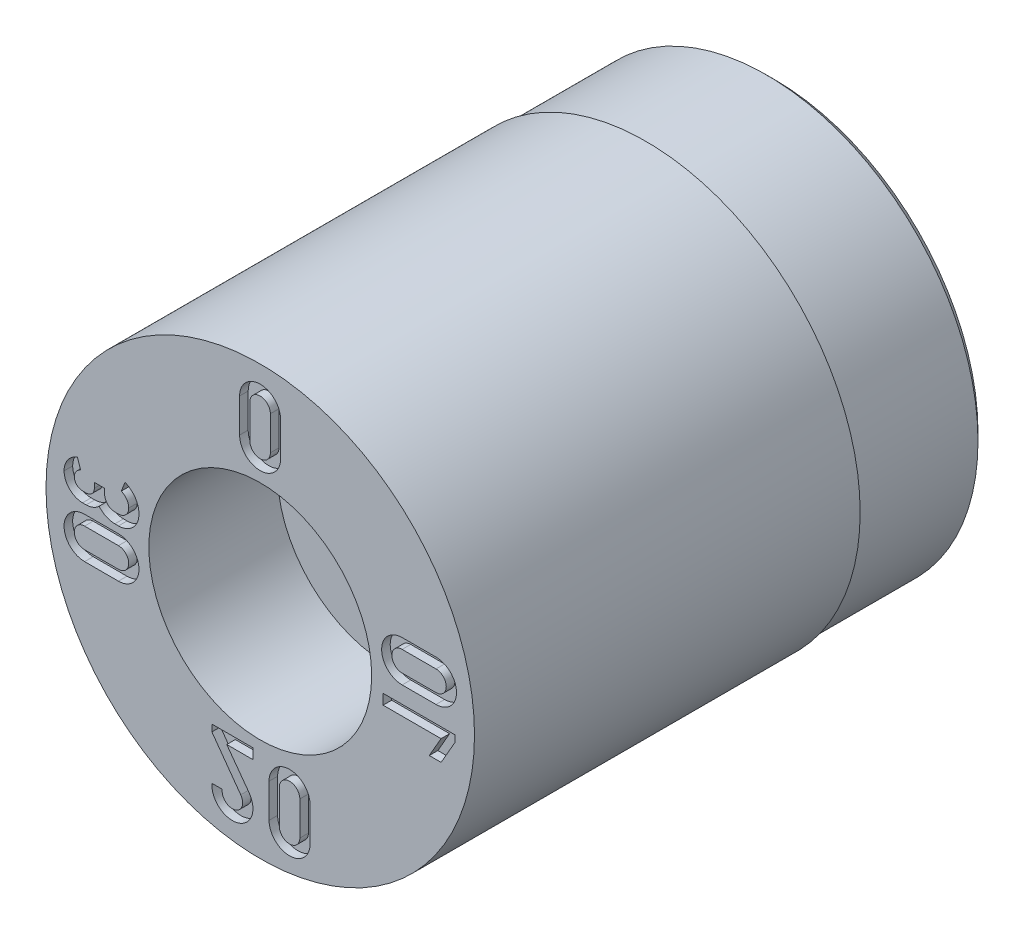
ISO-10303-21;
HEADER;
FILE_DESCRIPTION(('STEP AP214'),'2;1');
FILE_NAME('part.step','',(''),(''),'','','');
FILE_SCHEMA(('AUTOMOTIVE_DESIGN { 1 0 10303 214 1 1 1 1 }'));
ENDSEC;
DATA;
#1=APPLICATION_CONTEXT('core data for automotive mechanical design processes');
#2=APPLICATION_PROTOCOL_DEFINITION('international standard','automotive_design',2000,#1);
#3=PRODUCT_CONTEXT('',#1,'mechanical');
#4=PRODUCT('Part','Part','',(#3));
#5=PRODUCT_RELATED_PRODUCT_CATEGORY('part','',(#4));
#6=PRODUCT_DEFINITION_FORMATION('','',#4);
#7=PRODUCT_DEFINITION_CONTEXT('part definition',#1,'design');
#8=PRODUCT_DEFINITION('design','',#6,#7);
#9=PRODUCT_DEFINITION_SHAPE('','',#8);
#10=(LENGTH_UNIT() NAMED_UNIT(*) SI_UNIT(.MILLI.,.METRE.));
#11=(NAMED_UNIT(*) PLANE_ANGLE_UNIT() SI_UNIT($,.RADIAN.));
#12=(NAMED_UNIT(*) SI_UNIT($,.STERADIAN.) SOLID_ANGLE_UNIT());
#13=UNCERTAINTY_MEASURE_WITH_UNIT(LENGTH_MEASURE(1.E-05),#10,'distance_accuracy_value','');
#14=(GEOMETRIC_REPRESENTATION_CONTEXT(3) GLOBAL_UNCERTAINTY_ASSIGNED_CONTEXT((#13)) GLOBAL_UNIT_ASSIGNED_CONTEXT((#10,
#11,#12)) REPRESENTATION_CONTEXT('',''));
#15=CARTESIAN_POINT('',(0.,0.,0.));
#16=DIRECTION('',(0.,0.,1.));
#17=DIRECTION('',(1.,0.,0.));
#18=AXIS2_PLACEMENT_3D('',#15,#16,#17);
#19=CARTESIAN_POINT('',(0.,0.,3.79790950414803));
#20=DIRECTION('',(0.,0.,1.));
#21=DIRECTION('',(1.,0.,0.));
#22=AXIS2_PLACEMENT_3D('',#19,#20,#21);
#23=CYLINDRICAL_SURFACE('',#22,5.);
#24=CARTESIAN_POINT('',(0.,0.,0.));
#25=DIRECTION('',(0.,0.,1.));
#26=DIRECTION('',(1.,0.,0.));
#27=AXIS2_PLACEMENT_3D('',#24,#25,#26);
#28=CIRCLE('',#27,5.);
#29=CARTESIAN_POINT('',(5.,0.,0.));
#30=VERTEX_POINT('',#29);
#31=EDGE_CURVE('E11',#30,#30,#28,.T.);
#32=ORIENTED_EDGE('',*,*,#31,.F.);
#33=EDGE_LOOP('',(#32));
#34=FACE_BOUND('',#33,.T.);
#35=CARTESIAN_POINT('',(0.,0.,-9.));
#36=DIRECTION('',(0.,0.,-1.));
#37=DIRECTION('',(-1.,0.,0.));
#38=AXIS2_PLACEMENT_3D('',#35,#36,#37);
#39=CIRCLE('',#38,5.);
#40=CARTESIAN_POINT('',(-5.,0.,-9.));
#41=VERTEX_POINT('',#40);
#42=EDGE_CURVE('E37',#41,#41,#39,.T.);
#43=ORIENTED_EDGE('',*,*,#42,.F.);
#44=EDGE_LOOP('',(#43));
#45=FACE_BOUND('',#44,.T.);
#46=ADVANCED_FACE('F34',(#34,#45),#23,.T.);
#47=CARTESIAN_POINT('',(0.,0.,-12.));
#48=DIRECTION('',(0.,0.,1.));
#49=DIRECTION('',(1.,0.,0.));
#50=AXIS2_PLACEMENT_3D('',#47,#48,#49);
#51=CONICAL_SURFACE('',#50,4.7499999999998,0.785398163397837);
#52=CARTESIAN_POINT('',(0.,0.,-12.));
#53=DIRECTION('',(0.,0.,1.));
#54=DIRECTION('',(1.,0.,0.));
#55=AXIS2_PLACEMENT_3D('',#52,#53,#54);
#56=CIRCLE('',#55,4.7499999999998);
#57=CARTESIAN_POINT('',(4.7499999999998,0.,-12.));
#58=VERTEX_POINT('',#57);
#59=EDGE_CURVE('E1032',#58,#58,#56,.T.);
#60=ORIENTED_EDGE('',*,*,#59,.T.);
#61=EDGE_LOOP('',(#60));
#62=FACE_BOUND('',#61,.T.);
#63=CARTESIAN_POINT('',(0.,0.,-11.8149999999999));
#64=DIRECTION('',(0.,0.,1.));
#65=DIRECTION('',(1.,0.,0.));
#66=AXIS2_PLACEMENT_3D('',#63,#64,#65);
#67=CIRCLE('',#66,4.935);
#68=CARTESIAN_POINT('',(4.935,0.,-11.8149999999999));
#69=VERTEX_POINT('',#68);
#70=EDGE_CURVE('E1031',#69,#69,#67,.T.);
#71=ORIENTED_EDGE('',*,*,#70,.F.);
#72=EDGE_LOOP('',(#71));
#73=FACE_BOUND('',#72,.T.);
#74=ADVANCED_FACE('F1054',(#62,#73),#51,.T.);
#75=CARTESIAN_POINT('',(0.,5.,0.));
#76=DIRECTION('',(0.,0.,-1.));
#77=DIRECTION('',(-1.,0.,0.));
#78=AXIS2_PLACEMENT_3D('',#75,#76,#77);
#79=PLANE('',#78);
#80=DIRECTION('',(0.999999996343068,-8.55211335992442E-05,0.));
#81=VECTOR('',#80,1.);
#82=CARTESIAN_POINT('',(-3.30957416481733,-1.04450543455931,0.));
#83=LINE('',#82,#81);
#84=CARTESIAN_POINT('',(-4.09945624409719,-1.04443788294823,0.));
#85=VERTEX_POINT('',#84);
#86=CARTESIAN_POINT('',(-3.30957416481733,-1.04450543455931,0.));
#87=VERTEX_POINT('',#86);
#88=EDGE_CURVE('E522',#85,#87,#83,.T.);
#89=ORIENTED_EDGE('',*,*,#88,.F.);
#90=CARTESIAN_POINT('',(-4.09941529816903,-0.565656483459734,0.));
#91=DIRECTION('',(0.,0.,1.));
#92=DIRECTION('',(1.,0.,0.));
#93=AXIS2_PLACEMENT_3D('',#90,#91,#92);
#94=CIRCLE('',#93,0.478781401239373);
#95=CARTESIAN_POINT('',(-4.09937435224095,-0.0868750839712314,0.));
#96=VERTEX_POINT('',#95);
#97=EDGE_CURVE('E50',#96,#85,#94,.T.);
#98=ORIENTED_EDGE('',*,*,#97,.F.);
#99=DIRECTION('',(-0.999999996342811,8.55241324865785E-05,0.));
#100=VECTOR('',#99,1.);
#101=CARTESIAN_POINT('',(-4.09937435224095,-0.0868750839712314,0.));
#102=LINE('',#101,#100);
#103=CARTESIAN_POINT('',(-3.30951166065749,-0.0869426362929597,0.));
#104=VERTEX_POINT('',#103);
#105=EDGE_CURVE('E511',#104,#96,#102,.T.);
#106=ORIENTED_EDGE('',*,*,#105,.F.);
#107=CARTESIAN_POINT('',(-3.30954291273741,-0.565724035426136,0.));
#108=DIRECTION('',(0.,0.,1.));
#109=DIRECTION('',(1.,0.,0.));
#110=AXIS2_PLACEMENT_3D('',#107,#108,#109);
#111=CIRCLE('',#110,0.478781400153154);
#112=EDGE_CURVE('E525',#87,#104,#111,.T.);
#113=ORIENTED_EDGE('',*,*,#112,.F.);
#114=EDGE_LOOP('',(#89,#98,#106,#113));
#115=FACE_BOUND('',#114,.T.);
#116=DIRECTION('',(8.43544746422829E-05,-0.999999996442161,0.));
#117=VECTOR('',#116,1.);
#118=CARTESIAN_POINT('',(-0.481559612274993,4.11216806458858,0.));
#119=LINE('',#118,#117);
#120=CARTESIAN_POINT('',(-0.481559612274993,4.11216806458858,0.));
#121=VERTEX_POINT('',#120);
#122=CARTESIAN_POINT('',(-0.481492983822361,3.32230537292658,0.));
#123=VERTEX_POINT('',#122);
#124=EDGE_CURVE('E586',#121,#123,#119,.T.);
#125=ORIENTED_EDGE('',*,*,#124,.F.);
#126=CARTESIAN_POINT('',(-0.00277821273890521,4.11220845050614,0.));
#127=DIRECTION('',(0.,0.,1.));
#128=DIRECTION('',(1.,0.,0.));
#129=AXIS2_PLACEMENT_3D('',#126,#127,#128);
#130=CIRCLE('',#129,0.478781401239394);
#131=CARTESIAN_POINT('',(0.476003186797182,4.11224883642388,0.));
#132=VERTEX_POINT('',#131);
#133=EDGE_CURVE('E564',#132,#121,#130,.T.);
#134=ORIENTED_EDGE('',*,*,#133,.F.);
#135=DIRECTION('',(8.53192128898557E-05,0.999999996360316,0.));
#136=VECTOR('',#135,1.);
#137=CARTESIAN_POINT('',(0.475935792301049,3.32233887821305,0.));
#138=LINE('',#137,#136);
#139=CARTESIAN_POINT('',(0.475935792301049,3.32233887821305,0.));
#140=VERTEX_POINT('',#139);
#141=EDGE_CURVE('E575',#140,#132,#138,.T.);
#142=ORIENTED_EDGE('',*,*,#141,.F.);
#143=CARTESIAN_POINT('',(-0.00277859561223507,3.32231788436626,0.));
#144=DIRECTION('',(0.,0.,1.));
#145=DIRECTION('',(1.,0.,0.));
#146=AXIS2_PLACEMENT_3D('',#143,#144,#145);
#147=CIRCLE('',#146,0.478714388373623);
#148=EDGE_CURVE('E589',#123,#140,#147,.T.);
#149=ORIENTED_EDGE('',*,*,#148,.F.);
#150=EDGE_LOOP('',(#125,#134,#142,#149));
#151=FACE_BOUND('',#150,.T.);
#152=DIRECTION('',(-8.43514763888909E-05,0.999999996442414,0.));
#153=VECTOR('',#152,1.);
#154=CARTESIAN_POINT('',(-0.171332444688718,-3.08168706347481,0.));
#155=LINE('',#154,#153);
#156=CARTESIAN_POINT('',(-0.171332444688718,-3.08168706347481,0.));
#157=VERTEX_POINT('',#156);
#158=CARTESIAN_POINT('',(-0.171352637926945,-2.84229305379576,0.));
#159=VERTEX_POINT('',#158);
#160=EDGE_CURVE('E633',#157,#159,#155,.T.);
#161=ORIENTED_EDGE('',*,*,#160,.F.);
#162=DIRECTION('',(0.999999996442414,8.43514759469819E-05,0.));
#163=VECTOR('',#162,1.);
#164=CARTESIAN_POINT('',(-0.781737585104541,-3.08173855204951,0.));
#165=LINE('',#164,#163);
#166=CARTESIAN_POINT('',(-0.781737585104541,-3.08173855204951,0.));
#167=VERTEX_POINT('',#166);
#168=EDGE_CURVE('E596',#167,#157,#165,.T.);
#169=ORIENTED_EDGE('',*,*,#168,.F.);
#170=DIRECTION('',(-0.589622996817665,0.80767860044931,0.));
#171=VECTOR('',#170,1.);
#172=CARTESIAN_POINT('',(-0.261095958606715,-3.79492494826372,0.));
#173=LINE('',#172,#171);
#174=CARTESIAN_POINT('',(-0.261095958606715,-3.79492494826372,0.));
#175=VERTEX_POINT('',#174);
#176=EDGE_CURVE('E607',#175,#167,#173,.T.);
#177=ORIENTED_EDGE('',*,*,#176,.F.);
#178=CARTESIAN_POINT('',(-0.649756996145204,-4.07474016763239,0.));
#179=DIRECTION('',(0.,0.,1.));
#180=DIRECTION('',(1.,0.,0.));
#181=AXIS2_PLACEMENT_3D('',#178,#179,#180);
#182=CIRCLE('',#181,0.478909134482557);
#183=CARTESIAN_POINT('',(-1.12734007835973,-4.03912614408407,0.));
#184=VERTEX_POINT('',#183);
#185=EDGE_CURVE('E651',#184,#175,#182,.T.);
#186=ORIENTED_EDGE('',*,*,#185,.F.);
#187=DIRECTION('',(-0.999999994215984,-0.000107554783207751,0.));
#188=VECTOR('',#187,1.);
#189=CARTESIAN_POINT('',(-0.886588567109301,-4.03910025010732,0.));
#190=LINE('',#189,#188);
#191=CARTESIAN_POINT('',(-0.886588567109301,-4.03910025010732,0.));
#192=VERTEX_POINT('',#191);
#193=EDGE_CURVE('E648',#192,#184,#190,.T.);
#194=ORIENTED_EDGE('',*,*,#193,.F.);
#195=CARTESIAN_POINT('',(-0.649877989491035,-4.07500293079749,0.));
#196=DIRECTION('',(0.,0.,-1.));
#197=DIRECTION('',(1.,0.,0.));
#198=AXIS2_PLACEMENT_3D('',#195,#196,#197);
#199=CIRCLE('',#198,0.239417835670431);
#200=CARTESIAN_POINT('',(-0.455620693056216,-3.9350565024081,0.));
#201=VERTEX_POINT('',#200);
#202=EDGE_CURVE('E645',#201,#192,#199,.T.);
#203=ORIENTED_EDGE('',*,*,#202,.F.);
#204=DIRECTION('',(0.584527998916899,-0.811373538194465,0.));
#205=VECTOR('',#204,1.);
#206=CARTESIAN_POINT('',(-1.12876804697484,-3.00067191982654,0.));
#207=LINE('',#206,#205);
#208=CARTESIAN_POINT('',(-1.12876804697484,-3.00067191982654,0.));
#209=VERTEX_POINT('',#208);
#210=EDGE_CURVE('E642',#209,#201,#207,.T.);
#211=ORIENTED_EDGE('',*,*,#210,.F.);
#212=DIRECTION('',(8.43514743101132E-05,-0.999999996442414,0.));
#213=VECTOR('',#212,1.);
#214=CARTESIAN_POINT('',(-1.12878139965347,-2.84237381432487,0.));
#215=LINE('',#214,#213);
#216=CARTESIAN_POINT('',(-1.12878139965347,-2.84237381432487,0.));
#217=VERTEX_POINT('',#216);
#218=EDGE_CURVE('E639',#217,#209,#215,.T.);
#219=ORIENTED_EDGE('',*,*,#218,.F.);
#220=DIRECTION('',(-0.999999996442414,-8.4351475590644E-05,0.));
#221=VECTOR('',#220,1.);
#222=CARTESIAN_POINT('',(-0.171352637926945,-2.84229305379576,0.));
#223=LINE('',#222,#221);
#224=EDGE_CURVE('E636',#159,#217,#223,.T.);
#225=ORIENTED_EDGE('',*,*,#224,.F.);
#226=EDGE_LOOP('',(#161,#169,#177,#186,#194,#203,#211,#219,#225));
#227=FACE_BOUND('',#226,.T.);
#228=DIRECTION('',(8.4899784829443E-05,-0.999999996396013,0.));
#229=VECTOR('',#228,1.);
#230=CARTESIAN_POINT('',(2.86714702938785,-0.462803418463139,0.));
#231=LINE('',#230,#229);
#232=CARTESIAN_POINT('',(2.86712671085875,-0.223479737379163,0.));
#233=VERTEX_POINT('',#232);
#234=CARTESIAN_POINT('',(2.86714702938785,-0.462803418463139,0.));
#235=VERTEX_POINT('',#234);
#236=EDGE_CURVE('E699',#233,#235,#231,.T.);
#237=ORIENTED_EDGE('',*,*,#236,.F.);
#238=DIRECTION('',(-0.999999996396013,-8.48997846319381E-05,0.));
#239=VECTOR('',#238,1.);
#240=CARTESIAN_POINT('',(2.86712671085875,-0.223479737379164,0.));
#241=LINE('',#240,#239);
#242=CARTESIAN_POINT('',(4.54259353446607,-0.223337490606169,0.));
#243=VERTEX_POINT('',#242);
#244=EDGE_CURVE('E658',#243,#233,#241,.T.);
#245=ORIENTED_EDGE('',*,*,#244,.F.);
#246=DIRECTION('',(-8.48997827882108E-05,0.999999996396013,0.));
#247=VECTOR('',#246,1.);
#248=CARTESIAN_POINT('',(4.54259353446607,-0.223337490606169,0.));
#249=LINE('',#248,#247);
#250=CARTESIAN_POINT('',(4.54260691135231,-0.380898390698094,0.));
#251=VERTEX_POINT('',#250);
#252=EDGE_CURVE('E679',#251,#243,#249,.T.);
#253=ORIENTED_EDGE('',*,*,#252,.F.);
#254=DIRECTION('',(0.498418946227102,0.866936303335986,0.));
#255=VECTOR('',#254,1.);
#256=CARTESIAN_POINT('',(4.54260691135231,-0.380898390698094,0.));
#257=LINE('',#256,#255);
#258=CARTESIAN_POINT('',(4.22036169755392,-0.941402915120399,0.));
#259=VERTEX_POINT('',#258);
#260=EDGE_CURVE('E711',#259,#251,#257,.T.);
#261=ORIENTED_EDGE('',*,*,#260,.F.);
#262=DIRECTION('',(0.999999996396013,8.48997839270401E-05,0.));
#263=VECTOR('',#262,1.);
#264=CARTESIAN_POINT('',(4.22036169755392,-0.941402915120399,0.));
#265=LINE('',#264,#263);
#266=CARTESIAN_POINT('',(3.94431178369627,-0.941426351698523,0.));
#267=VERTEX_POINT('',#266);
#268=EDGE_CURVE('E708',#267,#259,#265,.T.);
#269=ORIENTED_EDGE('',*,*,#268,.F.);
#270=DIRECTION('',(-0.498285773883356,-0.867012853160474,0.));
#271=VECTOR('',#270,1.);
#272=CARTESIAN_POINT('',(3.94431178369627,-0.941426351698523,0.));
#273=LINE('',#272,#271);
#274=CARTESIAN_POINT('',(4.21944981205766,-0.462688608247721,0.));
#275=VERTEX_POINT('',#274);
#276=EDGE_CURVE('E705',#275,#267,#273,.T.);
#277=ORIENTED_EDGE('',*,*,#276,.F.);
#278=DIRECTION('',(0.999999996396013,8.48997846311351E-05,0.));
#279=VECTOR('',#278,1.);
#280=CARTESIAN_POINT('',(4.21944981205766,-0.462688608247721,0.));
#281=LINE('',#280,#279);
#282=EDGE_CURVE('E702',#235,#275,#281,.T.);
#283=ORIENTED_EDGE('',*,*,#282,.F.);
#284=EDGE_LOOP('',(#237,#245,#253,#261,#269,#277,#283));
#285=FACE_BOUND('',#284,.T.);
#286=DIRECTION('',(-0.999999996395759,-8.49027839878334E-05,0.));
#287=VECTOR('',#286,1.);
#288=CARTESIAN_POINT('',(4.10137319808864,1.1265305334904,0.));
#289=LINE('',#288,#287);
#290=CARTESIAN_POINT('',(4.10137319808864,1.1265305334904,0.));
#291=VERTEX_POINT('',#290);
#292=CARTESIAN_POINT('',(3.31151050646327,1.12646347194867,0.));
#293=VERTEX_POINT('',#292);
#294=EDGE_CURVE('E779',#291,#293,#289,.T.);
#295=ORIENTED_EDGE('',*,*,#294,.F.);
#296=CARTESIAN_POINT('',(4.10141384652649,0.647749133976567,0.));
#297=DIRECTION('',(0.,0.,1.));
#298=DIRECTION('',(1.,0.,0.));
#299=AXIS2_PLACEMENT_3D('',#296,#297,#298);
#300=CIRCLE('',#299,0.478781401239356);
#301=CARTESIAN_POINT('',(4.10145449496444,0.168967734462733,0.));
#302=VERTEX_POINT('',#301);
#303=EDGE_CURVE('E757',#302,#291,#300,.T.);
#304=ORIENTED_EDGE('',*,*,#303,.F.);
#305=DIRECTION('',(0.999999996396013,8.48997850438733E-05,0.));
#306=VECTOR('',#305,1.);
#307=CARTESIAN_POINT('',(3.31157241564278,0.168900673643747,0.));
#308=LINE('',#307,#306);
#309=CARTESIAN_POINT('',(3.31157241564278,0.168900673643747,0.));
#310=VERTEX_POINT('',#309);
#311=EDGE_CURVE('E768',#310,#302,#308,.T.);
#312=ORIENTED_EDGE('',*,*,#311,.F.);
#313=CARTESIAN_POINT('',(3.311551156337,0.647682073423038,0.));
#314=DIRECTION('',(0.,0.,1.));
#315=DIRECTION('',(1.,0.,0.));
#316=AXIS2_PLACEMENT_3D('',#313,#314,#315);
#317=CIRCLE('',#316,0.478781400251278);
#318=EDGE_CURVE('E782',#293,#310,#317,.T.);
#319=ORIENTED_EDGE('',*,*,#318,.F.);
#320=EDGE_LOOP('',(#295,#304,#312,#319));
#321=FACE_BOUND('',#320,.T.);
#322=DIRECTION('',(-0.999999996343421,8.55170029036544E-05,0.));
#323=VECTOR('',#322,1.);
#324=CARTESIAN_POINT('',(-3.30893222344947,0.312303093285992,0.));
#325=LINE('',#324,#323);
#326=CARTESIAN_POINT('',(-3.30893222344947,0.312303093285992,0.));
#327=VERTEX_POINT('',#326);
#328=CARTESIAN_POINT('',(-3.39270767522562,0.312310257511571,0.));
#329=VERTEX_POINT('',#328);
#330=EDGE_CURVE('E862',#327,#329,#325,.T.);
#331=ORIENTED_EDGE('',*,*,#330,.F.);
#332=CARTESIAN_POINT('',(-3.30891175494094,0.551653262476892,0.));
#333=DIRECTION('',(0.,0.,-1.));
#334=DIRECTION('',(1.,0.,0.));
#335=AXIS2_PLACEMENT_3D('',#332,#333,#334);
#336=CIRCLE('',#335,0.239350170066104);
#337=CARTESIAN_POINT('',(-3.06956158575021,0.551632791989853,0.));
#338=VERTEX_POINT('',#337);
#339=EDGE_CURVE('E789',#338,#327,#336,.T.);
#340=ORIENTED_EDGE('',*,*,#339,.F.);
#341=CARTESIAN_POINT('',(-3.34487088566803,0.551656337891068,0.));
#342=DIRECTION('',(0.,0.,-1.));
#343=DIRECTION('',(1.,0.,0.));
#344=AXIS2_PLACEMENT_3D('',#341,#342,#343);
#345=CIRCLE('',#344,0.2753093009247);
#346=CARTESIAN_POINT('',(-3.24380141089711,0.807742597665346,0.));
#347=VERTEX_POINT('',#346);
#348=EDGE_CURVE('E800',#347,#338,#345,.T.);
#349=ORIENTED_EDGE('',*,*,#348,.F.);
#350=DIRECTION('',(-0.367087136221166,-0.930186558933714,0.));
#351=VECTOR('',#350,1.);
#352=CARTESIAN_POINT('',(-3.15595992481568,1.03032999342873,0.));
#353=LINE('',#352,#351);
#354=CARTESIAN_POINT('',(-3.15595992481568,1.03032999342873,0.));
#355=VERTEX_POINT('',#354);
#356=EDGE_CURVE('E916',#355,#347,#353,.T.);
#357=ORIENTED_EDGE('',*,*,#356,.F.);
#358=CARTESIAN_POINT('',(-3.34498821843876,0.551543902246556,0.));
#359=DIRECTION('',(0.,0.,1.));
#360=DIRECTION('',(1.,0.,0.));
#361=AXIS2_PLACEMENT_3D('',#358,#359,#360);
#362=CIRCLE('',#361,0.51475024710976);
#363=CARTESIAN_POINT('',(-2.83023797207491,0.551571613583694,0.));
#364=VERTEX_POINT('',#363);
#365=EDGE_CURVE('E913',#364,#355,#362,.T.);
#366=ORIENTED_EDGE('',*,*,#365,.F.);
#367=CARTESIAN_POINT('',(-3.30887139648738,0.551545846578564,0.));
#368=DIRECTION('',(0.,0.,1.));
#369=DIRECTION('',(1.,0.,0.));
#370=AXIS2_PLACEMENT_3D('',#367,#368,#369);
#371=CIRCLE('',#370,0.478633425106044);
#372=CARTESIAN_POINT('',(-3.30891220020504,0.0729124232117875,0.));
#373=VERTEX_POINT('',#372);
#374=EDGE_CURVE('E910',#373,#364,#371,.T.);
#375=ORIENTED_EDGE('',*,*,#374,.F.);
#376=DIRECTION('',(0.99999999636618,-8.52504561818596E-05,0.));
#377=VECTOR('',#376,1.);
#378=CARTESIAN_POINT('',(-3.39271833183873,0.0729195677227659,0.));
#379=LINE('',#378,#377);
#380=CARTESIAN_POINT('',(-3.39271833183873,0.0729195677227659,0.));
#381=VERTEX_POINT('',#380);
#382=EDGE_CURVE('E907',#381,#373,#379,.T.);
#383=ORIENTED_EDGE('',*,*,#382,.F.);
#384=CARTESIAN_POINT('',(-3.39279266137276,0.551432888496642,0.));
#385=DIRECTION('',(0.,0.,1.));
#386=DIRECTION('',(1.,0.,0.));
#387=AXIS2_PLACEMENT_3D('',#384,#385,#386);
#388=CIRCLE('',#387,0.47851332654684);
#389=CARTESIAN_POINT('',(-3.76030999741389,0.244992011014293,0.));
#390=VERTEX_POINT('',#389);
#391=EDGE_CURVE('E904',#390,#381,#388,.T.);
#392=ORIENTED_EDGE('',*,*,#391,.F.);
#393=CARTESIAN_POINT('',(-4.06284518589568,0.551485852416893,0.));
#394=DIRECTION('',(0.,0.,1.));
#395=DIRECTION('',(1.,0.,0.));
#396=AXIS2_PLACEMENT_3D('',#393,#394,#395);
#397=CIRCLE('',#396,0.430657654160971);
#398=CARTESIAN_POINT('',(-4.06288218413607,0.1208281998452,0.));
#399=VERTEX_POINT('',#398);
#400=EDGE_CURVE('E901',#399,#390,#397,.T.);
#401=ORIENTED_EDGE('',*,*,#400,.F.);
#402=DIRECTION('',(0.999999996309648,-8.59110265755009E-05,0.));
#403=VECTOR('',#402,1.);
#404=CARTESIAN_POINT('',(-4.14662224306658,0.120835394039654,0.));
#405=LINE('',#404,#403);
#406=CARTESIAN_POINT('',(-4.14662224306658,0.120835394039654,0.));
#407=VERTEX_POINT('',#406);
#408=EDGE_CURVE('E898',#407,#399,#405,.T.);
#409=ORIENTED_EDGE('',*,*,#408,.F.);
#410=CARTESIAN_POINT('',(-4.14665194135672,0.551636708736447,0.));
#411=DIRECTION('',(0.,0.,1.));
#412=DIRECTION('',(1.,0.,0.));
#413=AXIS2_PLACEMENT_3D('',#410,#411,#412);
#414=CIRCLE('',#413,0.430801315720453);
#415=CARTESIAN_POINT('',(-4.5774532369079,0.551768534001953,0.));
#416=VERTEX_POINT('',#415);
#417=EDGE_CURVE('E895',#416,#407,#414,.T.);
#418=ORIENTED_EDGE('',*,*,#417,.F.);
#419=CARTESIAN_POINT('',(-4.12255897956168,0.551629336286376,0.));
#420=DIRECTION('',(0.,0.,1.));
#421=DIRECTION('',(1.,0.,0.));
#422=AXIS2_PLACEMENT_3D('',#419,#420,#421);
#423=CIRCLE('',#422,0.454894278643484);
#424=CARTESIAN_POINT('',(-4.26822072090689,0.982571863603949,0.));
#425=VERTEX_POINT('',#424);
#426=EDGE_CURVE('E892',#425,#416,#423,.T.);
#427=ORIENTED_EDGE('',*,*,#426,.F.);
#428=DIRECTION('',(-0.319923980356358,0.947443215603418,0.));
#429=VECTOR('',#428,1.);
#430=CARTESIAN_POINT('',(-4.1916367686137,0.755771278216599,0.));
#431=LINE('',#430,#429);
#432=CARTESIAN_POINT('',(-4.1916367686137,0.755771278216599,0.));
#433=VERTEX_POINT('',#432);
#434=EDGE_CURVE('E889',#433,#425,#431,.T.);
#435=ORIENTED_EDGE('',*,*,#434,.F.);
#436=CARTESIAN_POINT('',(-4.12296106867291,0.551897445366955,0.));
#437=DIRECTION('',(0.,0.,-1.));
#438=DIRECTION('',(1.,0.,0.));
#439=AXIS2_PLACEMENT_3D('',#436,#437,#438);
#440=CIRCLE('',#439,0.215129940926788);
#441=CARTESIAN_POINT('',(-4.3380909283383,0.551710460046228,0.));
#442=VERTEX_POINT('',#441);
#443=EDGE_CURVE('E886',#442,#433,#440,.T.);
#444=ORIENTED_EDGE('',*,*,#443,.F.);
#445=CARTESIAN_POINT('',(-4.14643995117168,0.551877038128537,0.));
#446=DIRECTION('',(0.,0.,-1.));
#447=DIRECTION('',(1.,0.,0.));
#448=AXIS2_PLACEMENT_3D('',#445,#446,#447);
#449=CIRCLE('',#448,0.191651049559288);
#450=CARTESIAN_POINT('',(-4.14662557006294,0.360226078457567,0.));
#451=VERTEX_POINT('',#450);
#452=EDGE_CURVE('E883',#451,#442,#449,.T.);
#453=ORIENTED_EDGE('',*,*,#452,.F.);
#454=DIRECTION('',(-0.999999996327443,8.57036442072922E-05,0.));
#455=VECTOR('',#454,1.);
#456=CARTESIAN_POINT('',(-4.06286171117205,0.360218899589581,0.));
#457=LINE('',#456,#455);
#458=CARTESIAN_POINT('',(-4.06286171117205,0.360218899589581,0.));
#459=VERTEX_POINT('',#458);
#460=EDGE_CURVE('E880',#459,#451,#457,.T.);
#461=ORIENTED_EDGE('',*,*,#460,.F.);
#462=CARTESIAN_POINT('',(-4.06284530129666,0.551691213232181,0.));
#463=DIRECTION('',(0.,0.,-1.));
#464=DIRECTION('',(1.,0.,0.));
#465=AXIS2_PLACEMENT_3D('',#462,#463,#464);
#466=CIRCLE('',#465,0.191472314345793);
#467=CARTESIAN_POINT('',(-3.87137298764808,0.551674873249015,0.));
#468=VERTEX_POINT('',#467);
#469=EDGE_CURVE('E877',#468,#459,#466,.T.);
#470=ORIENTED_EDGE('',*,*,#469,.F.);
#471=DIRECTION('',(-8.55211336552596E-05,-0.999999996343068,0.));
#472=VECTOR('',#471,1.);
#473=CARTESIAN_POINT('',(-3.87136275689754,0.671303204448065,0.));
#474=LINE('',#473,#472);
#475=CARTESIAN_POINT('',(-3.87136275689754,0.671303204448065,0.));
#476=VERTEX_POINT('',#475);
#477=EDGE_CURVE('E874',#476,#468,#474,.T.);
#478=ORIENTED_EDGE('',*,*,#477,.F.);
#479=DIRECTION('',(-0.999999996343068,8.55211334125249E-05,0.));
#480=VECTOR('',#479,1.);
#481=CARTESIAN_POINT('',(-3.63197205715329,0.67128273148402,0.));
#482=LINE('',#481,#480);
#483=CARTESIAN_POINT('',(-3.63197205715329,0.67128273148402,0.));
#484=VERTEX_POINT('',#483);
#485=EDGE_CURVE('E871',#484,#476,#482,.T.);
#486=ORIENTED_EDGE('',*,*,#485,.F.);
#487=DIRECTION('',(8.54959125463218E-05,0.999999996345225,0.));
#488=VECTOR('',#487,1.);
#489=CARTESIAN_POINT('',(-3.63198228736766,0.551625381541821,0.));
#490=LINE('',#489,#488);
#491=CARTESIAN_POINT('',(-3.63198228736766,0.551625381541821,0.));
#492=VERTEX_POINT('',#491);
#493=EDGE_CURVE('E868',#492,#484,#490,.T.);
#494=ORIENTED_EDGE('',*,*,#493,.F.);
#495=CARTESIAN_POINT('',(-3.39268762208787,0.55160492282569,0.));
#496=DIRECTION('',(0.,0.,-1.));
#497=DIRECTION('',(1.,0.,0.));
#498=AXIS2_PLACEMENT_3D('',#495,#496,#497);
#499=CIRCLE('',#498,0.239294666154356);
#500=EDGE_CURVE('E865',#329,#492,#499,.T.);
#501=ORIENTED_EDGE('',*,*,#500,.F.);
#502=EDGE_LOOP('',(#331,#340,#349,#357,#366,#375,#383,#392,#401,#409,#418,#427,#435,#444,#453,
#461,#470,#478,#486,#494,#501));
#503=FACE_BOUND('',#502,.T.);
#504=DIRECTION('',(8.53270660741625E-05,0.999999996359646,0.));
#505=VECTOR('',#504,1.);
#506=CARTESIAN_POINT('',(1.16301610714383,-4.12026824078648,0.));
#507=LINE('',#506,#505);
#508=CARTESIAN_POINT('',(1.16301610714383,-4.12026824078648,0.));
#509=VERTEX_POINT('',#508);
#510=CARTESIAN_POINT('',(1.16308350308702,-3.33041402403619,0.));
#511=VERTEX_POINT('',#510);
#512=EDGE_CURVE('E1012',#509,#511,#507,.T.);
#513=ORIENTED_EDGE('',*,*,#512,.F.);
#514=CARTESIAN_POINT('',(0.68423470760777,-4.12030862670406,0.));
#515=DIRECTION('',(0.,0.,1.));
#516=DIRECTION('',(1.,0.,0.));
#517=AXIS2_PLACEMENT_3D('',#514,#515,#516);
#518=CIRCLE('',#517,0.478781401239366);
#519=CARTESIAN_POINT('',(0.20545330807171,-4.12034901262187,0.));
#520=VERTEX_POINT('',#519);
#521=EDGE_CURVE('E990',#520,#509,#518,.T.);
#522=ORIENTED_EDGE('',*,*,#521,.F.);
#523=DIRECTION('',(8.43514759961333E-05,-0.999999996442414,0.));
#524=VECTOR('',#523,1.);
#525=CARTESIAN_POINT('',(0.205386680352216,-3.33046693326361,0.));
#526=LINE('',#525,#524);
#527=CARTESIAN_POINT('',(0.205386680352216,-3.33046693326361,0.));
#528=VERTEX_POINT('',#527);
#529=EDGE_CURVE('E1001',#528,#520,#526,.T.);
#530=ORIENTED_EDGE('',*,*,#529,.F.);
#531=CARTESIAN_POINT('',(0.6842350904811,-3.33041806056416,0.));
#532=DIRECTION('',(0.,0.,1.));
#533=DIRECTION('',(1.,0.,0.));
#534=AXIS2_PLACEMENT_3D('',#531,#532,#533);
#535=CIRCLE('',#534,0.478848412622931);
#536=EDGE_CURVE('E1015',#511,#528,#535,.T.);
#537=ORIENTED_EDGE('',*,*,#536,.F.);
#538=EDGE_LOOP('',(#513,#522,#530,#537));
#539=FACE_BOUND('',#538,.T.);
#540=CARTESIAN_POINT('',(0.,0.,0.));
#541=DIRECTION('',(0.,0.,1.));
#542=DIRECTION('',(1.,0.,0.));
#543=AXIS2_PLACEMENT_3D('',#540,#541,#542);
#544=CIRCLE('',#543,2.6);
#545=CARTESIAN_POINT('',(2.6,0.,0.));
#546=VERTEX_POINT('',#545);
#547=EDGE_CURVE('E42',#546,#546,#544,.T.);
#548=ORIENTED_EDGE('',*,*,#547,.F.);
#549=EDGE_LOOP('',(#548));
#550=FACE_BOUND('',#549,.T.);
#551=ORIENTED_EDGE('',*,*,#31,.T.);
#552=EDGE_LOOP('',(#551));
#553=FACE_BOUND('',#552,.T.);
#554=ADVANCED_FACE('F1059',(#115,#151,#227,#285,#321,#503,#539,#550,#553),#79,.F.);
#555=CARTESIAN_POINT('',(0.,0.,3.79790950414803));
#556=DIRECTION('',(0.,0.,1.));
#557=DIRECTION('',(1.,0.,0.));
#558=AXIS2_PLACEMENT_3D('',#555,#556,#557);
#559=CYLINDRICAL_SURFACE('',#558,2.6);
#560=CARTESIAN_POINT('',(0.,0.,-3.));
#561=DIRECTION('',(0.,0.,1.));
#562=DIRECTION('',(1.,0.,0.));
#563=AXIS2_PLACEMENT_3D('',#560,#561,#562);
#564=CIRCLE('',#563,2.6);
#565=CARTESIAN_POINT('',(2.6,0.,-3.));
#566=VERTEX_POINT('',#565);
#567=EDGE_CURVE('E1041',#566,#566,#564,.T.);
#568=ORIENTED_EDGE('',*,*,#567,.F.);
#569=EDGE_LOOP('',(#568));
#570=FACE_BOUND('',#569,.T.);
#571=ORIENTED_EDGE('',*,*,#547,.T.);
#572=EDGE_LOOP('',(#571));
#573=FACE_BOUND('',#572,.T.);
#574=ADVANCED_FACE('F1065',(#570,#573),#559,.F.);
#575=CARTESIAN_POINT('',(0.,2.6,-3.));
#576=DIRECTION('',(0.,0.,-1.));
#577=DIRECTION('',(-1.,0.,0.));
#578=AXIS2_PLACEMENT_3D('',#575,#576,#577);
#579=PLANE('',#578);
#580=CARTESIAN_POINT('',(0.,0.,-3.));
#581=DIRECTION('',(0.,0.,1.));
#582=DIRECTION('',(1.,0.,0.));
#583=AXIS2_PLACEMENT_3D('',#580,#581,#582);
#584=CIRCLE('',#583,1.25);
#585=CARTESIAN_POINT('',(1.25,0.,-3.));
#586=VERTEX_POINT('',#585);
#587=EDGE_CURVE('E1038',#586,#586,#584,.T.);
#588=ORIENTED_EDGE('',*,*,#587,.F.);
#589=EDGE_LOOP('',(#588));
#590=FACE_BOUND('',#589,.T.);
#591=ORIENTED_EDGE('',*,*,#567,.T.);
#592=EDGE_LOOP('',(#591));
#593=FACE_BOUND('',#592,.T.);
#594=ADVANCED_FACE('F1072',(#590,#593),#579,.F.);
#595=CARTESIAN_POINT('',(0.,0.,3.79790950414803));
#596=DIRECTION('',(0.,0.,1.));
#597=DIRECTION('',(1.,0.,0.));
#598=AXIS2_PLACEMENT_3D('',#595,#596,#597);
#599=CYLINDRICAL_SURFACE('',#598,1.25);
#600=CARTESIAN_POINT('',(0.,0.,-12.));
#601=DIRECTION('',(0.,0.,1.));
#602=DIRECTION('',(1.,0.,0.));
#603=AXIS2_PLACEMENT_3D('',#600,#601,#602);
#604=CIRCLE('',#603,1.25);
#605=CARTESIAN_POINT('',(1.25,0.,-12.));
#606=VERTEX_POINT('',#605);
#607=EDGE_CURVE('E1035',#606,#606,#604,.T.);
#608=ORIENTED_EDGE('',*,*,#607,.F.);
#609=EDGE_LOOP('',(#608));
#610=FACE_BOUND('',#609,.T.);
#611=ORIENTED_EDGE('',*,*,#587,.T.);
#612=EDGE_LOOP('',(#611));
#613=FACE_BOUND('',#612,.T.);
#614=ADVANCED_FACE('F1223',(#610,#613),#599,.F.);
#615=CARTESIAN_POINT('',(0.,1.25,-12.));
#616=DIRECTION('',(0.,0.,1.));
#617=DIRECTION('',(1.,0.,0.));
#618=AXIS2_PLACEMENT_3D('',#615,#616,#617);
#619=PLANE('',#618);
#620=ORIENTED_EDGE('',*,*,#59,.F.);
#621=EDGE_LOOP('',(#620));
#622=FACE_BOUND('',#621,.T.);
#623=ORIENTED_EDGE('',*,*,#607,.T.);
#624=EDGE_LOOP('',(#623));
#625=FACE_BOUND('',#624,.T.);
#626=ADVANCED_FACE('F1218',(#622,#625),#619,.F.);
#627=CARTESIAN_POINT('',(0.,5.935,-9.));
#628=DIRECTION('',(0.,0.,-1.));
#629=DIRECTION('',(-1.,0.,0.));
#630=AXIS2_PLACEMENT_3D('',#627,#628,#629);
#631=PLANE('',#630);
#632=CARTESIAN_POINT('',(0.,0.,-9.));
#633=DIRECTION('',(0.,0.,1.));
#634=DIRECTION('',(1.,0.,0.));
#635=AXIS2_PLACEMENT_3D('',#632,#633,#634);
#636=CIRCLE('',#635,4.935);
#637=CARTESIAN_POINT('',(4.935,0.,-9.));
#638=VERTEX_POINT('',#637);
#639=EDGE_CURVE('E1022',#638,#638,#636,.T.);
#640=ORIENTED_EDGE('',*,*,#639,.T.);
#641=EDGE_LOOP('',(#640));
#642=FACE_BOUND('',#641,.T.);
#643=ORIENTED_EDGE('',*,*,#42,.T.);
#644=EDGE_LOOP('',(#643));
#645=FACE_BOUND('',#644,.T.);
#646=ADVANCED_FACE('F1051',(#642,#645),#631,.T.);
#647=CARTESIAN_POINT('',(0.,0.,0.));
#648=DIRECTION('',(0.,0.,1.));
#649=DIRECTION('',(1.,0.,0.));
#650=AXIS2_PLACEMENT_3D('',#647,#648,#649);
#651=CYLINDRICAL_SURFACE('',#650,4.935);
#652=ORIENTED_EDGE('',*,*,#639,.F.);
#653=EDGE_LOOP('',(#652));
#654=FACE_BOUND('',#653,.T.);
#655=ORIENTED_EDGE('',*,*,#70,.T.);
#656=EDGE_LOOP('',(#655));
#657=FACE_BOUND('',#656,.T.);
#658=ADVANCED_FACE('F1213',(#654,#657),#651,.T.);
#659=CARTESIAN_POINT('',(0.68423470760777,-4.12030862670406,-0.2));
#660=DIRECTION('',(0.,0.,1.));
#661=DIRECTION('',(1.,0.,0.));
#662=AXIS2_PLACEMENT_3D('',#659,#660,#661);
#663=CYLINDRICAL_SURFACE('',#662,0.478781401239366);
#664=ORIENTED_EDGE('',*,*,#521,.T.);
#665=DIRECTION('',(0.,0.,1.));
#666=VECTOR('',#665,1.);
#667=CARTESIAN_POINT('',(1.16301610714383,-4.12026824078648,-0.2));
#668=LINE('',#667,#666);
#669=CARTESIAN_POINT('',(1.16301610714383,-4.12026824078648,-0.2));
#670=VERTEX_POINT('',#669);
#671=EDGE_CURVE('E1010',#670,#509,#668,.T.);
#672=ORIENTED_EDGE('',*,*,#671,.F.);
#673=CARTESIAN_POINT('',(0.68423470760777,-4.12030862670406,-0.2));
#674=DIRECTION('',(0.,0.,1.));
#675=DIRECTION('',(1.,0.,0.));
#676=AXIS2_PLACEMENT_3D('',#673,#674,#675);
#677=CIRCLE('',#676,0.478781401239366);
#678=CARTESIAN_POINT('',(0.20545330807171,-4.12034901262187,-0.2));
#679=VERTEX_POINT('',#678);
#680=EDGE_CURVE('E997',#679,#670,#677,.T.);
#681=ORIENTED_EDGE('',*,*,#680,.F.);
#682=DIRECTION('',(0.,0.,1.));
#683=VECTOR('',#682,1.);
#684=CARTESIAN_POINT('',(0.20545330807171,-4.12034901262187,-0.2));
#685=LINE('',#684,#683);
#686=EDGE_CURVE('E1020',#679,#520,#685,.T.);
#687=ORIENTED_EDGE('',*,*,#686,.T.);
#688=EDGE_LOOP('',(#664,#672,#681,#687));
#689=FACE_BOUND('',#688,.T.);
#690=ADVANCED_FACE('F1185',(#689),#663,.F.);
#691=CARTESIAN_POINT('',(0.205386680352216,-3.33046693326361,-0.2));
#692=DIRECTION('',(-0.999999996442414,-8.43514759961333E-05,0.));
#693=DIRECTION('',(8.43514759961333E-05,-0.999999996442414,0.));
#694=AXIS2_PLACEMENT_3D('',#691,#692,#693);
#695=PLANE('',#694);
#696=ORIENTED_EDGE('',*,*,#529,.T.);
#697=ORIENTED_EDGE('',*,*,#686,.F.);
#698=DIRECTION('',(8.43514759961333E-05,-0.999999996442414,0.));
#699=VECTOR('',#698,1.);
#700=CARTESIAN_POINT('',(0.205386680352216,-3.33046693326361,-0.2));
#701=LINE('',#700,#699);
#702=CARTESIAN_POINT('',(0.205386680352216,-3.33046693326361,-0.2));
#703=VERTEX_POINT('',#702);
#704=EDGE_CURVE('E1007',#703,#679,#701,.T.);
#705=ORIENTED_EDGE('',*,*,#704,.F.);
#706=DIRECTION('',(0.,0.,1.));
#707=VECTOR('',#706,1.);
#708=CARTESIAN_POINT('',(0.205386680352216,-3.33046693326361,-0.2));
#709=LINE('',#708,#707);
#710=EDGE_CURVE('E1023',#703,#528,#709,.T.);
#711=ORIENTED_EDGE('',*,*,#710,.T.);
#712=EDGE_LOOP('',(#696,#697,#705,#711));
#713=FACE_BOUND('',#712,.T.);
#714=ADVANCED_FACE('F1188',(#713),#695,.F.);
#715=CARTESIAN_POINT('',(0.6842350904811,-3.33041806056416,-0.2));
#716=DIRECTION('',(0.,0.,1.));
#717=DIRECTION('',(1.,0.,0.));
#718=AXIS2_PLACEMENT_3D('',#715,#716,#717);
#719=CYLINDRICAL_SURFACE('',#718,0.478848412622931);
#720=ORIENTED_EDGE('',*,*,#536,.T.);
#721=ORIENTED_EDGE('',*,*,#710,.F.);
#722=CARTESIAN_POINT('',(0.6842350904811,-3.33041806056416,-0.2));
#723=DIRECTION('',(0.,0.,1.));
#724=DIRECTION('',(1.,0.,0.));
#725=AXIS2_PLACEMENT_3D('',#722,#723,#724);
#726=CIRCLE('',#725,0.478848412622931);
#727=CARTESIAN_POINT('',(1.16308350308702,-3.33041402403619,-0.2));
#728=VERTEX_POINT('',#727);
#729=EDGE_CURVE('E1004',#728,#703,#726,.T.);
#730=ORIENTED_EDGE('',*,*,#729,.F.);
#731=DIRECTION('',(0.,0.,1.));
#732=VECTOR('',#731,1.);
#733=CARTESIAN_POINT('',(1.16308350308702,-3.33041402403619,-0.2));
#734=LINE('',#733,#732);
#735=EDGE_CURVE('E1025',#728,#511,#734,.T.);
#736=ORIENTED_EDGE('',*,*,#735,.T.);
#737=EDGE_LOOP('',(#720,#721,#730,#736));
#738=FACE_BOUND('',#737,.T.);
#739=ADVANCED_FACE('F1190',(#738),#719,.F.);
#740=CARTESIAN_POINT('',(1.16301610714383,-4.12026824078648,-0.2));
#741=DIRECTION('',(0.999999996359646,-8.53270660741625E-05,0.));
#742=DIRECTION('',(8.53270660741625E-05,0.999999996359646,0.));
#743=AXIS2_PLACEMENT_3D('',#740,#741,#742);
#744=PLANE('',#743);
#745=ORIENTED_EDGE('',*,*,#512,.T.);
#746=ORIENTED_EDGE('',*,*,#735,.F.);
#747=DIRECTION('',(8.53270660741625E-05,0.999999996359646,0.));
#748=VECTOR('',#747,1.);
#749=CARTESIAN_POINT('',(1.16301610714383,-4.12026824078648,-0.2));
#750=LINE('',#749,#748);
#751=EDGE_CURVE('E1000',#670,#728,#750,.T.);
#752=ORIENTED_EDGE('',*,*,#751,.F.);
#753=ORIENTED_EDGE('',*,*,#671,.T.);
#754=EDGE_LOOP('',(#745,#746,#752,#753));
#755=FACE_BOUND('',#754,.T.);
#756=ADVANCED_FACE('F1180',(#755),#744,.F.);
#757=CARTESIAN_POINT('',(0.68423470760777,-4.12030862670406,-0.2));
#758=DIRECTION('',(0.,0.,1.));
#759=DIRECTION('',(1.,0.,0.));
#760=AXIS2_PLACEMENT_3D('',#757,#758,#759);
#761=PLANE('',#760);
#762=DIRECTION('',(8.53190860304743E-05,0.999999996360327,0.));
#763=VECTOR('',#762,1.);
#764=CARTESIAN_POINT('',(0.923558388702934,-4.12028843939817,-0.2));
#765=LINE('',#764,#763);
#766=CARTESIAN_POINT('',(0.923558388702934,-4.12028843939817,-0.2));
#767=VERTEX_POINT('',#766);
#768=CARTESIAN_POINT('',(0.923625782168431,-3.33038938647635,-0.2));
#769=VERTEX_POINT('',#768);
#770=EDGE_CURVE('E974',#767,#769,#765,.T.);
#771=ORIENTED_EDGE('',*,*,#770,.F.);
#772=CARTESIAN_POINT('',(0.68423470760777,-4.12030862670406,-0.2));
#773=DIRECTION('',(0.,0.,1.));
#774=DIRECTION('',(1.,0.,0.));
#775=AXIS2_PLACEMENT_3D('',#772,#773,#774);
#776=CIRCLE('',#775,0.239323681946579);
#777=CARTESIAN_POINT('',(0.444911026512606,-4.12032881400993,-0.2));
#778=VERTEX_POINT('',#777);
#779=EDGE_CURVE('E971',#778,#767,#776,.T.);
#780=ORIENTED_EDGE('',*,*,#779,.F.);
#781=DIRECTION('',(8.43514751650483E-05,-0.999999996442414,0.));
#782=VECTOR('',#781,1.);
#783=CARTESIAN_POINT('',(0.444844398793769,-3.33044673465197,-0.2));
#784=LINE('',#783,#782);
#785=CARTESIAN_POINT('',(0.444844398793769,-3.33044673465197,-0.2));
#786=VERTEX_POINT('',#785);
#787=EDGE_CURVE('E967',#786,#778,#784,.T.);
#788=ORIENTED_EDGE('',*,*,#787,.F.);
#789=CARTESIAN_POINT('',(0.6842350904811,-3.33041806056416,-0.2));
#790=DIRECTION('',(0.,0.,1.));
#791=DIRECTION('',(1.,0.,0.));
#792=AXIS2_PLACEMENT_3D('',#789,#790,#791);
#793=CIRCLE('',#792,0.239390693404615);
#794=EDGE_CURVE('E964',#769,#786,#793,.T.);
#795=ORIENTED_EDGE('',*,*,#794,.F.);
#796=EDGE_LOOP('',(#771,#780,#788,#795));
#797=FACE_BOUND('',#796,.T.);
#798=ORIENTED_EDGE('',*,*,#680,.T.);
#799=ORIENTED_EDGE('',*,*,#751,.T.);
#800=ORIENTED_EDGE('',*,*,#729,.T.);
#801=ORIENTED_EDGE('',*,*,#704,.T.);
#802=EDGE_LOOP('',(#798,#799,#800,#801));
#803=FACE_BOUND('',#802,.T.);
#804=ADVANCED_FACE('F1192',(#797,#803),#761,.T.);
#805=CARTESIAN_POINT('',(0.6842350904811,-3.33041806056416,-0.2));
#806=DIRECTION('',(0.,0.,1.));
#807=DIRECTION('',(1.,0.,0.));
#808=AXIS2_PLACEMENT_3D('',#805,#806,#807);
#809=CYLINDRICAL_SURFACE('',#808,0.239390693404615);
#810=CARTESIAN_POINT('',(0.6842350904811,-3.33041806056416,0.));
#811=DIRECTION('',(0.,0.,1.));
#812=DIRECTION('',(1.,0.,0.));
#813=AXIS2_PLACEMENT_3D('',#810,#811,#812);
#814=CIRCLE('',#813,0.239390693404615);
#815=CARTESIAN_POINT('',(0.923625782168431,-3.33038938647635,0.));
#816=VERTEX_POINT('',#815);
#817=CARTESIAN_POINT('',(0.444844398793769,-3.33044673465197,0.));
#818=VERTEX_POINT('',#817);
#819=EDGE_CURVE('E923',#816,#818,#814,.T.);
#820=ORIENTED_EDGE('',*,*,#819,.F.);
#821=DIRECTION('',(0.,0.,1.));
#822=VECTOR('',#821,1.);
#823=CARTESIAN_POINT('',(0.923625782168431,-3.33038938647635,-0.2));
#824=LINE('',#823,#822);
#825=EDGE_CURVE('E988',#769,#816,#824,.T.);
#826=ORIENTED_EDGE('',*,*,#825,.F.);
#827=ORIENTED_EDGE('',*,*,#794,.T.);
#828=DIRECTION('',(0.,0.,1.));
#829=VECTOR('',#828,1.);
#830=CARTESIAN_POINT('',(0.444844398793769,-3.33044673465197,-0.2));
#831=LINE('',#830,#829);
#832=EDGE_CURVE('E977',#786,#818,#831,.T.);
#833=ORIENTED_EDGE('',*,*,#832,.T.);
#834=EDGE_LOOP('',(#820,#826,#827,#833));
#835=FACE_BOUND('',#834,.T.);
#836=ADVANCED_FACE('F1194',(#835),#809,.T.);
#837=CARTESIAN_POINT('',(0.923558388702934,-4.12028843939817,-0.2));
#838=DIRECTION('',(0.999999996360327,-8.53190860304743E-05,0.));
#839=DIRECTION('',(8.53190860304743E-05,0.999999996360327,0.));
#840=AXIS2_PLACEMENT_3D('',#837,#838,#839);
#841=PLANE('',#840);
#842=DIRECTION('',(8.53190860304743E-05,0.999999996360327,0.));
#843=VECTOR('',#842,1.);
#844=CARTESIAN_POINT('',(0.923558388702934,-4.12028843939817,0.));
#845=LINE('',#844,#843);
#846=CARTESIAN_POINT('',(0.923558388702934,-4.12028843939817,0.));
#847=VERTEX_POINT('',#846);
#848=EDGE_CURVE('E968',#847,#816,#845,.T.);
#849=ORIENTED_EDGE('',*,*,#848,.F.);
#850=DIRECTION('',(0.,0.,1.));
#851=VECTOR('',#850,1.);
#852=CARTESIAN_POINT('',(0.923558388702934,-4.12028843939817,-0.2));
#853=LINE('',#852,#851);
#854=EDGE_CURVE('E991',#767,#847,#853,.T.);
#855=ORIENTED_EDGE('',*,*,#854,.F.);
#856=ORIENTED_EDGE('',*,*,#770,.T.);
#857=ORIENTED_EDGE('',*,*,#825,.T.);
#858=EDGE_LOOP('',(#849,#855,#856,#857));
#859=FACE_BOUND('',#858,.T.);
#860=ADVANCED_FACE('F1201',(#859),#841,.T.);
#861=CARTESIAN_POINT('',(0.68423470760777,-4.12030862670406,-0.2));
#862=DIRECTION('',(0.,0.,1.));
#863=DIRECTION('',(1.,0.,0.));
#864=AXIS2_PLACEMENT_3D('',#861,#862,#863);
#865=CYLINDRICAL_SURFACE('',#864,0.239323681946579);
#866=CARTESIAN_POINT('',(0.68423470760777,-4.12030862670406,0.));
#867=DIRECTION('',(0.,0.,1.));
#868=DIRECTION('',(1.,0.,0.));
#869=AXIS2_PLACEMENT_3D('',#866,#867,#868);
#870=CIRCLE('',#869,0.239323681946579);
#871=CARTESIAN_POINT('',(0.444911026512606,-4.12032881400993,0.));
#872=VERTEX_POINT('',#871);
#873=EDGE_CURVE('E983',#872,#847,#870,.T.);
#874=ORIENTED_EDGE('',*,*,#873,.F.);
#875=DIRECTION('',(0.,0.,1.));
#876=VECTOR('',#875,1.);
#877=CARTESIAN_POINT('',(0.444911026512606,-4.12032881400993,-0.2));
#878=LINE('',#877,#876);
#879=EDGE_CURVE('E993',#778,#872,#878,.T.);
#880=ORIENTED_EDGE('',*,*,#879,.F.);
#881=ORIENTED_EDGE('',*,*,#779,.T.);
#882=ORIENTED_EDGE('',*,*,#854,.T.);
#883=EDGE_LOOP('',(#874,#880,#881,#882));
#884=FACE_BOUND('',#883,.T.);
#885=ADVANCED_FACE('F1092',(#884),#865,.T.);
#886=CARTESIAN_POINT('',(0.444844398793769,-3.33044673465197,-0.2));
#887=DIRECTION('',(-0.999999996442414,-8.43514751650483E-05,0.));
#888=DIRECTION('',(8.43514751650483E-05,-0.999999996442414,0.));
#889=AXIS2_PLACEMENT_3D('',#886,#887,#888);
#890=PLANE('',#889);
#891=DIRECTION('',(8.43514751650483E-05,-0.999999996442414,0.));
#892=VECTOR('',#891,1.);
#893=CARTESIAN_POINT('',(0.444844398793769,-3.33044673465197,0.));
#894=LINE('',#893,#892);
#895=EDGE_CURVE('E980',#818,#872,#894,.T.);
#896=ORIENTED_EDGE('',*,*,#895,.F.);
#897=ORIENTED_EDGE('',*,*,#832,.F.);
#898=ORIENTED_EDGE('',*,*,#787,.T.);
#899=ORIENTED_EDGE('',*,*,#879,.T.);
#900=EDGE_LOOP('',(#896,#897,#898,#899));
#901=FACE_BOUND('',#900,.T.);
#902=ADVANCED_FACE('F1082',(#901),#890,.T.);
#903=ORIENTED_EDGE('',*,*,#819,.T.);
#904=ORIENTED_EDGE('',*,*,#895,.T.);
#905=ORIENTED_EDGE('',*,*,#873,.T.);
#906=ORIENTED_EDGE('',*,*,#848,.T.);
#907=EDGE_LOOP('',(#903,#904,#905,#906));
#908=FACE_BOUND('',#907,.T.);
#909=ADVANCED_FACE('F1068',(#908),#79,.F.);
#910=CARTESIAN_POINT('',(-3.30891175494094,0.551653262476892,-0.2));
#911=DIRECTION('',(0.,0.,1.));
#912=DIRECTION('',(1.,0.,0.));
#913=AXIS2_PLACEMENT_3D('',#910,#911,#912);
#914=CYLINDRICAL_SURFACE('',#913,0.239350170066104);
#915=ORIENTED_EDGE('',*,*,#339,.T.);
#916=DIRECTION('',(0.,0.,1.));
#917=VECTOR('',#916,1.);
#918=CARTESIAN_POINT('',(-3.30893222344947,0.312303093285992,-0.2));
#919=LINE('',#918,#917);
#920=CARTESIAN_POINT('',(-3.30893222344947,0.312303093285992,-0.2));
#921=VERTEX_POINT('',#920);
#922=EDGE_CURVE('E860',#921,#327,#919,.T.);
#923=ORIENTED_EDGE('',*,*,#922,.F.);
#924=CARTESIAN_POINT('',(-3.30891175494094,0.551653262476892,-0.2));
#925=DIRECTION('',(0.,0.,-1.));
#926=DIRECTION('',(1.,0.,0.));
#927=AXIS2_PLACEMENT_3D('',#924,#925,#926);
#928=CIRCLE('',#927,0.239350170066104);
#929=CARTESIAN_POINT('',(-3.06956158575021,0.551632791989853,-0.2));
#930=VERTEX_POINT('',#929);
#931=EDGE_CURVE('E796',#930,#921,#928,.T.);
#932=ORIENTED_EDGE('',*,*,#931,.F.);
#933=DIRECTION('',(0.,0.,1.));
#934=VECTOR('',#933,1.);
#935=CARTESIAN_POINT('',(-3.06956158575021,0.551632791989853,-0.2));
#936=LINE('',#935,#934);
#937=EDGE_CURVE('E921',#930,#338,#936,.T.);
#938=ORIENTED_EDGE('',*,*,#937,.T.);
#939=EDGE_LOOP('',(#915,#923,#932,#938));
#940=FACE_BOUND('',#939,.T.);
#941=ADVANCED_FACE('F1081',(#940),#914,.T.);
#942=CARTESIAN_POINT('',(-3.34487088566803,0.551656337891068,-0.2));
#943=DIRECTION('',(0.,0.,1.));
#944=DIRECTION('',(1.,0.,0.));
#945=AXIS2_PLACEMENT_3D('',#942,#943,#944);
#946=CYLINDRICAL_SURFACE('',#945,0.2753093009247);
#947=ORIENTED_EDGE('',*,*,#348,.T.);
#948=ORIENTED_EDGE('',*,*,#937,.F.);
#949=CARTESIAN_POINT('',(-3.34487088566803,0.551656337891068,-0.2));
#950=DIRECTION('',(0.,0.,-1.));
#951=DIRECTION('',(1.,0.,0.));
#952=AXIS2_PLACEMENT_3D('',#949,#950,#951);
#953=CIRCLE('',#952,0.2753093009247);
#954=CARTESIAN_POINT('',(-3.24380141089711,0.807742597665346,-0.2));
#955=VERTEX_POINT('',#954);
#956=EDGE_CURVE('E857',#955,#930,#953,.T.);
#957=ORIENTED_EDGE('',*,*,#956,.F.);
#958=DIRECTION('',(0.,0.,1.));
#959=VECTOR('',#958,1.);
#960=CARTESIAN_POINT('',(-3.24380141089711,0.807742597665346,-0.2));
#961=LINE('',#960,#959);
#962=EDGE_CURVE('E924',#955,#347,#961,.T.);
#963=ORIENTED_EDGE('',*,*,#962,.T.);
#964=EDGE_LOOP('',(#947,#948,#957,#963));
#965=FACE_BOUND('',#964,.T.);
#966=ADVANCED_FACE('F1089',(#965),#946,.T.);
#967=CARTESIAN_POINT('',(-3.15595992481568,1.03032999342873,-0.2));
#968=DIRECTION('',(-0.930186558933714,0.367087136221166,0.));
#969=DIRECTION('',(-0.367087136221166,-0.930186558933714,0.));
#970=AXIS2_PLACEMENT_3D('',#967,#968,#969);
#971=PLANE('',#970);
#972=ORIENTED_EDGE('',*,*,#356,.T.);
#973=ORIENTED_EDGE('',*,*,#962,.F.);
#974=DIRECTION('',(-0.367087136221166,-0.930186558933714,0.));
#975=VECTOR('',#974,1.);
#976=CARTESIAN_POINT('',(-3.15595992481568,1.03032999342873,-0.2));
#977=LINE('',#976,#975);
#978=CARTESIAN_POINT('',(-3.15595992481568,1.03032999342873,-0.2));
#979=VERTEX_POINT('',#978);
#980=EDGE_CURVE('E854',#979,#955,#977,.T.);
#981=ORIENTED_EDGE('',*,*,#980,.F.);
#982=DIRECTION('',(0.,0.,1.));
#983=VECTOR('',#982,1.);
#984=CARTESIAN_POINT('',(-3.15595992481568,1.03032999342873,-0.2));
#985=LINE('',#984,#983);
#986=EDGE_CURVE('E926',#979,#355,#985,.T.);
#987=ORIENTED_EDGE('',*,*,#986,.T.);
#988=EDGE_LOOP('',(#972,#973,#981,#987));
#989=FACE_BOUND('',#988,.T.);
#990=ADVANCED_FACE('F1325',(#989),#971,.F.);
#991=CARTESIAN_POINT('',(-3.34498821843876,0.551543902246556,-0.2));
#992=DIRECTION('',(0.,0.,1.));
#993=DIRECTION('',(1.,0.,0.));
#994=AXIS2_PLACEMENT_3D('',#991,#992,#993);
#995=CYLINDRICAL_SURFACE('',#994,0.51475024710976);
#996=ORIENTED_EDGE('',*,*,#365,.T.);
#997=ORIENTED_EDGE('',*,*,#986,.F.);
#998=CARTESIAN_POINT('',(-3.34498821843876,0.551543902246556,-0.2));
#999=DIRECTION('',(0.,0.,1.));
#1000=DIRECTION('',(1.,0.,0.));
#1001=AXIS2_PLACEMENT_3D('',#998,#999,#1000);
#1002=CIRCLE('',#1001,0.51475024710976);
#1003=CARTESIAN_POINT('',(-2.83023797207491,0.551571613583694,-0.2));
#1004=VERTEX_POINT('',#1003);
#1005=EDGE_CURVE('E851',#1004,#979,#1002,.T.);
#1006=ORIENTED_EDGE('',*,*,#1005,.F.);
#1007=DIRECTION('',(0.,0.,1.));
#1008=VECTOR('',#1007,1.);
#1009=CARTESIAN_POINT('',(-2.83023797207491,0.551571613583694,-0.2));
#1010=LINE('',#1009,#1008);
#1011=EDGE_CURVE('E928',#1004,#364,#1010,.T.);
#1012=ORIENTED_EDGE('',*,*,#1011,.T.);
#1013=EDGE_LOOP('',(#996,#997,#1006,#1012));
#1014=FACE_BOUND('',#1013,.T.);
#1015=ADVANCED_FACE('F1335',(#1014),#995,.F.);
#1016=CARTESIAN_POINT('',(-3.30887139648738,0.551545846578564,-0.2));
#1017=DIRECTION('',(0.,0.,1.));
#1018=DIRECTION('',(1.,0.,0.));
#1019=AXIS2_PLACEMENT_3D('',#1016,#1017,#1018);
#1020=CYLINDRICAL_SURFACE('',#1019,0.478633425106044);
#1021=ORIENTED_EDGE('',*,*,#374,.T.);
#1022=ORIENTED_EDGE('',*,*,#1011,.F.);
#1023=CARTESIAN_POINT('',(-3.30887139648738,0.551545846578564,-0.2));
#1024=DIRECTION('',(0.,0.,1.));
#1025=DIRECTION('',(1.,0.,0.));
#1026=AXIS2_PLACEMENT_3D('',#1023,#1024,#1025);
#1027=CIRCLE('',#1026,0.478633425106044);
#1028=CARTESIAN_POINT('',(-3.30891220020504,0.0729124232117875,-0.2));
#1029=VERTEX_POINT('',#1028);
#1030=EDGE_CURVE('E848',#1029,#1004,#1027,.T.);
#1031=ORIENTED_EDGE('',*,*,#1030,.F.);
#1032=DIRECTION('',(0.,0.,1.));
#1033=VECTOR('',#1032,1.);
#1034=CARTESIAN_POINT('',(-3.30891220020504,0.0729124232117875,-0.2));
#1035=LINE('',#1034,#1033);
#1036=EDGE_CURVE('E930',#1029,#373,#1035,.T.);
#1037=ORIENTED_EDGE('',*,*,#1036,.T.);
#1038=EDGE_LOOP('',(#1021,#1022,#1031,#1037));
#1039=FACE_BOUND('',#1038,.T.);
#1040=ADVANCED_FACE('F1345',(#1039),#1020,.F.);
#1041=CARTESIAN_POINT('',(-3.39271833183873,0.0729195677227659,-0.2));
#1042=DIRECTION('',(-8.52504561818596E-05,-0.99999999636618,0.));
#1043=DIRECTION('',(0.99999999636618,-8.52504561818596E-05,0.));
#1044=AXIS2_PLACEMENT_3D('',#1041,#1042,#1043);
#1045=PLANE('',#1044);
#1046=ORIENTED_EDGE('',*,*,#382,.T.);
#1047=ORIENTED_EDGE('',*,*,#1036,.F.);
#1048=DIRECTION('',(0.99999999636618,-8.52504561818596E-05,0.));
#1049=VECTOR('',#1048,1.);
#1050=CARTESIAN_POINT('',(-3.39271833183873,0.0729195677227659,-0.2));
#1051=LINE('',#1050,#1049);
#1052=CARTESIAN_POINT('',(-3.39271833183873,0.0729195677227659,-0.2));
#1053=VERTEX_POINT('',#1052);
#1054=EDGE_CURVE('E845',#1053,#1029,#1051,.T.);
#1055=ORIENTED_EDGE('',*,*,#1054,.F.);
#1056=DIRECTION('',(0.,0.,1.));
#1057=VECTOR('',#1056,1.);
#1058=CARTESIAN_POINT('',(-3.39271833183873,0.0729195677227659,-0.2));
#1059=LINE('',#1058,#1057);
#1060=EDGE_CURVE('E932',#1053,#381,#1059,.T.);
#1061=ORIENTED_EDGE('',*,*,#1060,.T.);
#1062=EDGE_LOOP('',(#1046,#1047,#1055,#1061));
#1063=FACE_BOUND('',#1062,.T.);
#1064=ADVANCED_FACE('F1355',(#1063),#1045,.F.);
#1065=CARTESIAN_POINT('',(-3.39279266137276,0.551432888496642,-0.2));
#1066=DIRECTION('',(0.,0.,1.));
#1067=DIRECTION('',(1.,0.,0.));
#1068=AXIS2_PLACEMENT_3D('',#1065,#1066,#1067);
#1069=CYLINDRICAL_SURFACE('',#1068,0.47851332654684);
#1070=ORIENTED_EDGE('',*,*,#391,.T.);
#1071=ORIENTED_EDGE('',*,*,#1060,.F.);
#1072=CARTESIAN_POINT('',(-3.39279266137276,0.551432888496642,-0.2));
#1073=DIRECTION('',(0.,0.,1.));
#1074=DIRECTION('',(1.,0.,0.));
#1075=AXIS2_PLACEMENT_3D('',#1072,#1073,#1074);
#1076=CIRCLE('',#1075,0.47851332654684);
#1077=CARTESIAN_POINT('',(-3.76030999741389,0.244992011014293,-0.2));
#1078=VERTEX_POINT('',#1077);
#1079=EDGE_CURVE('E842',#1078,#1053,#1076,.T.);
#1080=ORIENTED_EDGE('',*,*,#1079,.F.);
#1081=DIRECTION('',(0.,0.,1.));
#1082=VECTOR('',#1081,1.);
#1083=CARTESIAN_POINT('',(-3.76030999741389,0.244992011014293,-0.2));
#1084=LINE('',#1083,#1082);
#1085=EDGE_CURVE('E934',#1078,#390,#1084,.T.);
#1086=ORIENTED_EDGE('',*,*,#1085,.T.);
#1087=EDGE_LOOP('',(#1070,#1071,#1080,#1086));
#1088=FACE_BOUND('',#1087,.T.);
#1089=ADVANCED_FACE('F1365',(#1088),#1069,.F.);
#1090=CARTESIAN_POINT('',(-4.06284518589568,0.551485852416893,-0.2));
#1091=DIRECTION('',(0.,0.,1.));
#1092=DIRECTION('',(1.,0.,0.));
#1093=AXIS2_PLACEMENT_3D('',#1090,#1091,#1092);
#1094=CYLINDRICAL_SURFACE('',#1093,0.430657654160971);
#1095=ORIENTED_EDGE('',*,*,#400,.T.);
#1096=ORIENTED_EDGE('',*,*,#1085,.F.);
#1097=CARTESIAN_POINT('',(-4.06284518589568,0.551485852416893,-0.2));
#1098=DIRECTION('',(0.,0.,1.));
#1099=DIRECTION('',(1.,0.,0.));
#1100=AXIS2_PLACEMENT_3D('',#1097,#1098,#1099);
#1101=CIRCLE('',#1100,0.430657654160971);
#1102=CARTESIAN_POINT('',(-4.06288218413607,0.1208281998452,-0.2));
#1103=VERTEX_POINT('',#1102);
#1104=EDGE_CURVE('E839',#1103,#1078,#1101,.T.);
#1105=ORIENTED_EDGE('',*,*,#1104,.F.);
#1106=DIRECTION('',(0.,0.,1.));
#1107=VECTOR('',#1106,1.);
#1108=CARTESIAN_POINT('',(-4.06288218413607,0.1208281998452,-0.2));
#1109=LINE('',#1108,#1107);
#1110=EDGE_CURVE('E936',#1103,#399,#1109,.T.);
#1111=ORIENTED_EDGE('',*,*,#1110,.T.);
#1112=EDGE_LOOP('',(#1095,#1096,#1105,#1111));
#1113=FACE_BOUND('',#1112,.T.);
#1114=ADVANCED_FACE('F1375',(#1113),#1094,.F.);
#1115=CARTESIAN_POINT('',(-4.14662224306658,0.120835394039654,-0.2));
#1116=DIRECTION('',(-8.59110265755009E-05,-0.999999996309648,0.));
#1117=DIRECTION('',(0.999999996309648,-8.59110265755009E-05,0.));
#1118=AXIS2_PLACEMENT_3D('',#1115,#1116,#1117);
#1119=PLANE('',#1118);
#1120=ORIENTED_EDGE('',*,*,#408,.T.);
#1121=ORIENTED_EDGE('',*,*,#1110,.F.);
#1122=DIRECTION('',(0.999999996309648,-8.59110265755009E-05,0.));
#1123=VECTOR('',#1122,1.);
#1124=CARTESIAN_POINT('',(-4.14662224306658,0.120835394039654,-0.2));
#1125=LINE('',#1124,#1123);
#1126=CARTESIAN_POINT('',(-4.14662224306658,0.120835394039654,-0.2));
#1127=VERTEX_POINT('',#1126);
#1128=EDGE_CURVE('E836',#1127,#1103,#1125,.T.);
#1129=ORIENTED_EDGE('',*,*,#1128,.F.);
#1130=DIRECTION('',(0.,0.,1.));
#1131=VECTOR('',#1130,1.);
#1132=CARTESIAN_POINT('',(-4.14662224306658,0.120835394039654,-0.2));
#1133=LINE('',#1132,#1131);
#1134=EDGE_CURVE('E938',#1127,#407,#1133,.T.);
#1135=ORIENTED_EDGE('',*,*,#1134,.T.);
#1136=EDGE_LOOP('',(#1120,#1121,#1129,#1135));
#1137=FACE_BOUND('',#1136,.T.);
#1138=ADVANCED_FACE('F1385',(#1137),#1119,.F.);
#1139=CARTESIAN_POINT('',(-4.14665194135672,0.551636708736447,-0.2));
#1140=DIRECTION('',(0.,0.,1.));
#1141=DIRECTION('',(1.,0.,0.));
#1142=AXIS2_PLACEMENT_3D('',#1139,#1140,#1141);
#1143=CYLINDRICAL_SURFACE('',#1142,0.430801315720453);
#1144=ORIENTED_EDGE('',*,*,#417,.T.);
#1145=ORIENTED_EDGE('',*,*,#1134,.F.);
#1146=CARTESIAN_POINT('',(-4.14665194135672,0.551636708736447,-0.2));
#1147=DIRECTION('',(0.,0.,1.));
#1148=DIRECTION('',(1.,0.,0.));
#1149=AXIS2_PLACEMENT_3D('',#1146,#1147,#1148);
#1150=CIRCLE('',#1149,0.430801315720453);
#1151=CARTESIAN_POINT('',(-4.5774532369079,0.551768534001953,-0.2));
#1152=VERTEX_POINT('',#1151);
#1153=EDGE_CURVE('E833',#1152,#1127,#1150,.T.);
#1154=ORIENTED_EDGE('',*,*,#1153,.F.);
#1155=DIRECTION('',(0.,0.,1.));
#1156=VECTOR('',#1155,1.);
#1157=CARTESIAN_POINT('',(-4.5774532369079,0.551768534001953,-0.2));
#1158=LINE('',#1157,#1156);
#1159=EDGE_CURVE('E940',#1152,#416,#1158,.T.);
#1160=ORIENTED_EDGE('',*,*,#1159,.T.);
#1161=EDGE_LOOP('',(#1144,#1145,#1154,#1160));
#1162=FACE_BOUND('',#1161,.T.);
#1163=ADVANCED_FACE('F1395',(#1162),#1143,.F.);
#1164=CARTESIAN_POINT('',(-4.12255897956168,0.551629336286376,-0.2));
#1165=DIRECTION('',(0.,0.,1.));
#1166=DIRECTION('',(1.,0.,0.));
#1167=AXIS2_PLACEMENT_3D('',#1164,#1165,#1166);
#1168=CYLINDRICAL_SURFACE('',#1167,0.454894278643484);
#1169=ORIENTED_EDGE('',*,*,#426,.T.);
#1170=ORIENTED_EDGE('',*,*,#1159,.F.);
#1171=CARTESIAN_POINT('',(-4.12255897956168,0.551629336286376,-0.2));
#1172=DIRECTION('',(0.,0.,1.));
#1173=DIRECTION('',(1.,0.,0.));
#1174=AXIS2_PLACEMENT_3D('',#1171,#1172,#1173);
#1175=CIRCLE('',#1174,0.454894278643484);
#1176=CARTESIAN_POINT('',(-4.26822072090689,0.982571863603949,-0.2));
#1177=VERTEX_POINT('',#1176);
#1178=EDGE_CURVE('E830',#1177,#1152,#1175,.T.);
#1179=ORIENTED_EDGE('',*,*,#1178,.F.);
#1180=DIRECTION('',(0.,0.,1.));
#1181=VECTOR('',#1180,1.);
#1182=CARTESIAN_POINT('',(-4.26822072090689,0.982571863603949,-0.2));
#1183=LINE('',#1182,#1181);
#1184=EDGE_CURVE('E942',#1177,#425,#1183,.T.);
#1185=ORIENTED_EDGE('',*,*,#1184,.T.);
#1186=EDGE_LOOP('',(#1169,#1170,#1179,#1185));
#1187=FACE_BOUND('',#1186,.T.);
#1188=ADVANCED_FACE('F1405',(#1187),#1168,.F.);
#1189=CARTESIAN_POINT('',(-4.1916367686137,0.755771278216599,-0.2));
#1190=DIRECTION('',(0.947443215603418,0.319923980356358,0.));
#1191=DIRECTION('',(-0.319923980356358,0.947443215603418,0.));
#1192=AXIS2_PLACEMENT_3D('',#1189,#1190,#1191);
#1193=PLANE('',#1192);
#1194=ORIENTED_EDGE('',*,*,#434,.T.);
#1195=ORIENTED_EDGE('',*,*,#1184,.F.);
#1196=DIRECTION('',(-0.319923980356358,0.947443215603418,0.));
#1197=VECTOR('',#1196,1.);
#1198=CARTESIAN_POINT('',(-4.1916367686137,0.755771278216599,-0.2));
#1199=LINE('',#1198,#1197);
#1200=CARTESIAN_POINT('',(-4.1916367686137,0.755771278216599,-0.2));
#1201=VERTEX_POINT('',#1200);
#1202=EDGE_CURVE('E827',#1201,#1177,#1199,.T.);
#1203=ORIENTED_EDGE('',*,*,#1202,.F.);
#1204=DIRECTION('',(0.,0.,1.));
#1205=VECTOR('',#1204,1.);
#1206=CARTESIAN_POINT('',(-4.1916367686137,0.755771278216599,-0.2));
#1207=LINE('',#1206,#1205);
#1208=EDGE_CURVE('E944',#1201,#433,#1207,.T.);
#1209=ORIENTED_EDGE('',*,*,#1208,.T.);
#1210=EDGE_LOOP('',(#1194,#1195,#1203,#1209));
#1211=FACE_BOUND('',#1210,.T.);
#1212=ADVANCED_FACE('F1415',(#1211),#1193,.F.);
#1213=CARTESIAN_POINT('',(-4.12296106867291,0.551897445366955,-0.2));
#1214=DIRECTION('',(0.,0.,1.));
#1215=DIRECTION('',(1.,0.,0.));
#1216=AXIS2_PLACEMENT_3D('',#1213,#1214,#1215);
#1217=CYLINDRICAL_SURFACE('',#1216,0.215129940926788);
#1218=ORIENTED_EDGE('',*,*,#443,.T.);
#1219=ORIENTED_EDGE('',*,*,#1208,.F.);
#1220=CARTESIAN_POINT('',(-4.12296106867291,0.551897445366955,-0.2));
#1221=DIRECTION('',(0.,0.,-1.));
#1222=DIRECTION('',(1.,0.,0.));
#1223=AXIS2_PLACEMENT_3D('',#1220,#1221,#1222);
#1224=CIRCLE('',#1223,0.215129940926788);
#1225=CARTESIAN_POINT('',(-4.3380909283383,0.551710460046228,-0.2));
#1226=VERTEX_POINT('',#1225);
#1227=EDGE_CURVE('E824',#1226,#1201,#1224,.T.);
#1228=ORIENTED_EDGE('',*,*,#1227,.F.);
#1229=DIRECTION('',(0.,0.,1.));
#1230=VECTOR('',#1229,1.);
#1231=CARTESIAN_POINT('',(-4.3380909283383,0.551710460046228,-0.2));
#1232=LINE('',#1231,#1230);
#1233=EDGE_CURVE('E946',#1226,#442,#1232,.T.);
#1234=ORIENTED_EDGE('',*,*,#1233,.T.);
#1235=EDGE_LOOP('',(#1218,#1219,#1228,#1234));
#1236=FACE_BOUND('',#1235,.T.);
#1237=ADVANCED_FACE('F1425',(#1236),#1217,.T.);
#1238=CARTESIAN_POINT('',(-4.14643995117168,0.551877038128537,-0.2));
#1239=DIRECTION('',(0.,0.,1.));
#1240=DIRECTION('',(1.,0.,0.));
#1241=AXIS2_PLACEMENT_3D('',#1238,#1239,#1240);
#1242=CYLINDRICAL_SURFACE('',#1241,0.191651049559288);
#1243=ORIENTED_EDGE('',*,*,#452,.T.);
#1244=ORIENTED_EDGE('',*,*,#1233,.F.);
#1245=CARTESIAN_POINT('',(-4.14643995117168,0.551877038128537,-0.2));
#1246=DIRECTION('',(0.,0.,-1.));
#1247=DIRECTION('',(1.,0.,0.));
#1248=AXIS2_PLACEMENT_3D('',#1245,#1246,#1247);
#1249=CIRCLE('',#1248,0.191651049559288);
#1250=CARTESIAN_POINT('',(-4.14662557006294,0.360226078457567,-0.2));
#1251=VERTEX_POINT('',#1250);
#1252=EDGE_CURVE('E821',#1251,#1226,#1249,.T.);
#1253=ORIENTED_EDGE('',*,*,#1252,.F.);
#1254=DIRECTION('',(0.,0.,1.));
#1255=VECTOR('',#1254,1.);
#1256=CARTESIAN_POINT('',(-4.14662557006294,0.360226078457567,-0.2));
#1257=LINE('',#1256,#1255);
#1258=EDGE_CURVE('E948',#1251,#451,#1257,.T.);
#1259=ORIENTED_EDGE('',*,*,#1258,.T.);
#1260=EDGE_LOOP('',(#1243,#1244,#1253,#1259));
#1261=FACE_BOUND('',#1260,.T.);
#1262=ADVANCED_FACE('F1435',(#1261),#1242,.T.);
#1263=CARTESIAN_POINT('',(-4.06286171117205,0.360218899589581,-0.2));
#1264=DIRECTION('',(8.57036442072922E-05,0.999999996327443,0.));
#1265=DIRECTION('',(-0.999999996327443,8.57036442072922E-05,0.));
#1266=AXIS2_PLACEMENT_3D('',#1263,#1264,#1265);
#1267=PLANE('',#1266);
#1268=ORIENTED_EDGE('',*,*,#460,.T.);
#1269=ORIENTED_EDGE('',*,*,#1258,.F.);
#1270=DIRECTION('',(-0.999999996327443,8.57036442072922E-05,0.));
#1271=VECTOR('',#1270,1.);
#1272=CARTESIAN_POINT('',(-4.06286171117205,0.360218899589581,-0.2));
#1273=LINE('',#1272,#1271);
#1274=CARTESIAN_POINT('',(-4.06286171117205,0.360218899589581,-0.2));
#1275=VERTEX_POINT('',#1274);
#1276=EDGE_CURVE('E818',#1275,#1251,#1273,.T.);
#1277=ORIENTED_EDGE('',*,*,#1276,.F.);
#1278=DIRECTION('',(0.,0.,1.));
#1279=VECTOR('',#1278,1.);
#1280=CARTESIAN_POINT('',(-4.06286171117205,0.360218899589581,-0.2));
#1281=LINE('',#1280,#1279);
#1282=EDGE_CURVE('E950',#1275,#459,#1281,.T.);
#1283=ORIENTED_EDGE('',*,*,#1282,.T.);
#1284=EDGE_LOOP('',(#1268,#1269,#1277,#1283));
#1285=FACE_BOUND('',#1284,.T.);
#1286=ADVANCED_FACE('F1445',(#1285),#1267,.F.);
#1287=CARTESIAN_POINT('',(-4.06284530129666,0.551691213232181,-0.2));
#1288=DIRECTION('',(0.,0.,1.));
#1289=DIRECTION('',(1.,0.,0.));
#1290=AXIS2_PLACEMENT_3D('',#1287,#1288,#1289);
#1291=CYLINDRICAL_SURFACE('',#1290,0.191472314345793);
#1292=ORIENTED_EDGE('',*,*,#469,.T.);
#1293=ORIENTED_EDGE('',*,*,#1282,.F.);
#1294=CARTESIAN_POINT('',(-4.06284530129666,0.551691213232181,-0.2));
#1295=DIRECTION('',(0.,0.,-1.));
#1296=DIRECTION('',(1.,0.,0.));
#1297=AXIS2_PLACEMENT_3D('',#1294,#1295,#1296);
#1298=CIRCLE('',#1297,0.191472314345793);
#1299=CARTESIAN_POINT('',(-3.87137298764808,0.551674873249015,-0.2));
#1300=VERTEX_POINT('',#1299);
#1301=EDGE_CURVE('E815',#1300,#1275,#1298,.T.);
#1302=ORIENTED_EDGE('',*,*,#1301,.F.);
#1303=DIRECTION('',(0.,0.,1.));
#1304=VECTOR('',#1303,1.);
#1305=CARTESIAN_POINT('',(-3.87137298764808,0.551674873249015,-0.2));
#1306=LINE('',#1305,#1304);
#1307=EDGE_CURVE('E952',#1300,#468,#1306,.T.);
#1308=ORIENTED_EDGE('',*,*,#1307,.T.);
#1309=EDGE_LOOP('',(#1292,#1293,#1302,#1308));
#1310=FACE_BOUND('',#1309,.T.);
#1311=ADVANCED_FACE('F1455',(#1310),#1291,.T.);
#1312=CARTESIAN_POINT('',(-3.87136275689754,0.671303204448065,-0.2));
#1313=DIRECTION('',(-0.999999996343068,8.55211336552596E-05,0.));
#1314=DIRECTION('',(-8.55211336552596E-05,-0.999999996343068,0.));
#1315=AXIS2_PLACEMENT_3D('',#1312,#1313,#1314);
#1316=PLANE('',#1315);
#1317=ORIENTED_EDGE('',*,*,#477,.T.);
#1318=ORIENTED_EDGE('',*,*,#1307,.F.);
#1319=DIRECTION('',(-8.55211336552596E-05,-0.999999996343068,0.));
#1320=VECTOR('',#1319,1.);
#1321=CARTESIAN_POINT('',(-3.87136275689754,0.671303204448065,-0.2));
#1322=LINE('',#1321,#1320);
#1323=CARTESIAN_POINT('',(-3.87136275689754,0.671303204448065,-0.2));
#1324=VERTEX_POINT('',#1323);
#1325=EDGE_CURVE('E812',#1324,#1300,#1322,.T.);
#1326=ORIENTED_EDGE('',*,*,#1325,.F.);
#1327=DIRECTION('',(0.,0.,1.));
#1328=VECTOR('',#1327,1.);
#1329=CARTESIAN_POINT('',(-3.87136275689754,0.671303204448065,-0.2));
#1330=LINE('',#1329,#1328);
#1331=EDGE_CURVE('E954',#1324,#476,#1330,.T.);
#1332=ORIENTED_EDGE('',*,*,#1331,.T.);
#1333=EDGE_LOOP('',(#1317,#1318,#1326,#1332));
#1334=FACE_BOUND('',#1333,.T.);
#1335=ADVANCED_FACE('F1465',(#1334),#1316,.F.);
#1336=CARTESIAN_POINT('',(-3.63197205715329,0.67128273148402,-0.2));
#1337=DIRECTION('',(8.55211334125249E-05,0.999999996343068,0.));
#1338=DIRECTION('',(-0.999999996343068,8.55211334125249E-05,0.));
#1339=AXIS2_PLACEMENT_3D('',#1336,#1337,#1338);
#1340=PLANE('',#1339);
#1341=ORIENTED_EDGE('',*,*,#485,.T.);
#1342=ORIENTED_EDGE('',*,*,#1331,.F.);
#1343=DIRECTION('',(-0.999999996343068,8.55211334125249E-05,0.));
#1344=VECTOR('',#1343,1.);
#1345=CARTESIAN_POINT('',(-3.63197205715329,0.67128273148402,-0.2));
#1346=LINE('',#1345,#1344);
#1347=CARTESIAN_POINT('',(-3.63197205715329,0.67128273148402,-0.2));
#1348=VERTEX_POINT('',#1347);
#1349=EDGE_CURVE('E809',#1348,#1324,#1346,.T.);
#1350=ORIENTED_EDGE('',*,*,#1349,.F.);
#1351=DIRECTION('',(0.,0.,1.));
#1352=VECTOR('',#1351,1.);
#1353=CARTESIAN_POINT('',(-3.63197205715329,0.67128273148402,-0.2));
#1354=LINE('',#1353,#1352);
#1355=EDGE_CURVE('E956',#1348,#484,#1354,.T.);
#1356=ORIENTED_EDGE('',*,*,#1355,.T.);
#1357=EDGE_LOOP('',(#1341,#1342,#1350,#1356));
#1358=FACE_BOUND('',#1357,.T.);
#1359=ADVANCED_FACE('F1475',(#1358),#1340,.F.);
#1360=CARTESIAN_POINT('',(-3.63198228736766,0.551625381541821,-0.2));
#1361=DIRECTION('',(0.999999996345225,-8.54959125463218E-05,0.));
#1362=DIRECTION('',(8.54959125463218E-05,0.999999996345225,0.));
#1363=AXIS2_PLACEMENT_3D('',#1360,#1361,#1362);
#1364=PLANE('',#1363);
#1365=ORIENTED_EDGE('',*,*,#493,.T.);
#1366=ORIENTED_EDGE('',*,*,#1355,.F.);
#1367=DIRECTION('',(8.54959125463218E-05,0.999999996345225,0.));
#1368=VECTOR('',#1367,1.);
#1369=CARTESIAN_POINT('',(-3.63198228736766,0.551625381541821,-0.2));
#1370=LINE('',#1369,#1368);
#1371=CARTESIAN_POINT('',(-3.63198228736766,0.551625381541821,-0.2));
#1372=VERTEX_POINT('',#1371);
#1373=EDGE_CURVE('E806',#1372,#1348,#1370,.T.);
#1374=ORIENTED_EDGE('',*,*,#1373,.F.);
#1375=DIRECTION('',(0.,0.,1.));
#1376=VECTOR('',#1375,1.);
#1377=CARTESIAN_POINT('',(-3.63198228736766,0.551625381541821,-0.2));
#1378=LINE('',#1377,#1376);
#1379=EDGE_CURVE('E958',#1372,#492,#1378,.T.);
#1380=ORIENTED_EDGE('',*,*,#1379,.T.);
#1381=EDGE_LOOP('',(#1365,#1366,#1374,#1380));
#1382=FACE_BOUND('',#1381,.T.);
#1383=ADVANCED_FACE('F1485',(#1382),#1364,.F.);
#1384=CARTESIAN_POINT('',(-3.39268762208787,0.55160492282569,-0.2));
#1385=DIRECTION('',(0.,0.,1.));
#1386=DIRECTION('',(1.,0.,0.));
#1387=AXIS2_PLACEMENT_3D('',#1384,#1385,#1386);
#1388=CYLINDRICAL_SURFACE('',#1387,0.239294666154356);
#1389=ORIENTED_EDGE('',*,*,#500,.T.);
#1390=ORIENTED_EDGE('',*,*,#1379,.F.);
#1391=CARTESIAN_POINT('',(-3.39268762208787,0.55160492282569,-0.2));
#1392=DIRECTION('',(0.,0.,-1.));
#1393=DIRECTION('',(1.,0.,0.));
#1394=AXIS2_PLACEMENT_3D('',#1391,#1392,#1393);
#1395=CIRCLE('',#1394,0.239294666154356);
#1396=CARTESIAN_POINT('',(-3.39270767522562,0.312310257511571,-0.2));
#1397=VERTEX_POINT('',#1396);
#1398=EDGE_CURVE('E803',#1397,#1372,#1395,.T.);
#1399=ORIENTED_EDGE('',*,*,#1398,.F.);
#1400=DIRECTION('',(0.,0.,1.));
#1401=VECTOR('',#1400,1.);
#1402=CARTESIAN_POINT('',(-3.39270767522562,0.312310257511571,-0.2));
#1403=LINE('',#1402,#1401);
#1404=EDGE_CURVE('E960',#1397,#329,#1403,.T.);
#1405=ORIENTED_EDGE('',*,*,#1404,.T.);
#1406=EDGE_LOOP('',(#1389,#1390,#1399,#1405));
#1407=FACE_BOUND('',#1406,.T.);
#1408=ADVANCED_FACE('F1495',(#1407),#1388,.T.);
#1409=CARTESIAN_POINT('',(-3.30893222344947,0.312303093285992,-0.2));
#1410=DIRECTION('',(8.55170029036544E-05,0.999999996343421,0.));
#1411=DIRECTION('',(-0.999999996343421,8.55170029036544E-05,0.));
#1412=AXIS2_PLACEMENT_3D('',#1409,#1410,#1411);
#1413=PLANE('',#1412);
#1414=ORIENTED_EDGE('',*,*,#330,.T.);
#1415=ORIENTED_EDGE('',*,*,#1404,.F.);
#1416=DIRECTION('',(-0.999999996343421,8.55170029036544E-05,0.));
#1417=VECTOR('',#1416,1.);
#1418=CARTESIAN_POINT('',(-3.30893222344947,0.312303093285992,-0.2));
#1419=LINE('',#1418,#1417);
#1420=EDGE_CURVE('E799',#921,#1397,#1419,.T.);
#1421=ORIENTED_EDGE('',*,*,#1420,.F.);
#1422=ORIENTED_EDGE('',*,*,#922,.T.);
#1423=EDGE_LOOP('',(#1414,#1415,#1421,#1422));
#1424=FACE_BOUND('',#1423,.T.);
#1425=ADVANCED_FACE('F1505',(#1424),#1413,.F.);
#1426=CARTESIAN_POINT('',(-3.30891175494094,0.551653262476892,-0.2));
#1427=DIRECTION('',(0.,0.,1.));
#1428=DIRECTION('',(1.,0.,0.));
#1429=AXIS2_PLACEMENT_3D('',#1426,#1427,#1428);
#1430=PLANE('',#1429);
#1431=ORIENTED_EDGE('',*,*,#931,.T.);
#1432=ORIENTED_EDGE('',*,*,#1420,.T.);
#1433=ORIENTED_EDGE('',*,*,#1398,.T.);
#1434=ORIENTED_EDGE('',*,*,#1373,.T.);
#1435=ORIENTED_EDGE('',*,*,#1349,.T.);
#1436=ORIENTED_EDGE('',*,*,#1325,.T.);
#1437=ORIENTED_EDGE('',*,*,#1301,.T.);
#1438=ORIENTED_EDGE('',*,*,#1276,.T.);
#1439=ORIENTED_EDGE('',*,*,#1252,.T.);
#1440=ORIENTED_EDGE('',*,*,#1227,.T.);
#1441=ORIENTED_EDGE('',*,*,#1202,.T.);
#1442=ORIENTED_EDGE('',*,*,#1178,.T.);
#1443=ORIENTED_EDGE('',*,*,#1153,.T.);
#1444=ORIENTED_EDGE('',*,*,#1128,.T.);
#1445=ORIENTED_EDGE('',*,*,#1104,.T.);
#1446=ORIENTED_EDGE('',*,*,#1079,.T.);
#1447=ORIENTED_EDGE('',*,*,#1054,.T.);
#1448=ORIENTED_EDGE('',*,*,#1030,.T.);
#1449=ORIENTED_EDGE('',*,*,#1005,.T.);
#1450=ORIENTED_EDGE('',*,*,#980,.T.);
#1451=ORIENTED_EDGE('',*,*,#956,.T.);
#1452=EDGE_LOOP('',(#1431,#1432,#1433,#1434,#1435,#1436,#1437,#1438,#1439,#1440,#1441,#1442,
#1443,#1444,#1445,#1446,#1447,#1448,#1449,#1450,#1451));
#1453=FACE_BOUND('',#1452,.T.);
#1454=ADVANCED_FACE('F1515',(#1453),#1430,.T.);
#1455=CARTESIAN_POINT('',(4.10141384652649,0.647749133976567,-0.2));
#1456=DIRECTION('',(0.,0.,1.));
#1457=DIRECTION('',(1.,0.,0.));
#1458=AXIS2_PLACEMENT_3D('',#1455,#1456,#1457);
#1459=CYLINDRICAL_SURFACE('',#1458,0.478781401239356);
#1460=ORIENTED_EDGE('',*,*,#303,.T.);
#1461=DIRECTION('',(0.,0.,1.));
#1462=VECTOR('',#1461,1.);
#1463=CARTESIAN_POINT('',(4.10137319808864,1.1265305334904,-0.2));
#1464=LINE('',#1463,#1462);
#1465=CARTESIAN_POINT('',(4.10137319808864,1.1265305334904,-0.2));
#1466=VERTEX_POINT('',#1465);
#1467=EDGE_CURVE('E777',#1466,#291,#1464,.T.);
#1468=ORIENTED_EDGE('',*,*,#1467,.F.);
#1469=CARTESIAN_POINT('',(4.10141384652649,0.647749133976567,-0.2));
#1470=DIRECTION('',(0.,0.,1.));
#1471=DIRECTION('',(1.,0.,0.));
#1472=AXIS2_PLACEMENT_3D('',#1469,#1470,#1471);
#1473=CIRCLE('',#1472,0.478781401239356);
#1474=CARTESIAN_POINT('',(4.10145449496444,0.168967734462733,-0.2));
#1475=VERTEX_POINT('',#1474);
#1476=EDGE_CURVE('E764',#1475,#1466,#1473,.T.);
#1477=ORIENTED_EDGE('',*,*,#1476,.F.);
#1478=DIRECTION('',(0.,0.,1.));
#1479=VECTOR('',#1478,1.);
#1480=CARTESIAN_POINT('',(4.10145449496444,0.168967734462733,-0.2));
#1481=LINE('',#1480,#1479);
#1482=EDGE_CURVE('E787',#1475,#302,#1481,.T.);
#1483=ORIENTED_EDGE('',*,*,#1482,.T.);
#1484=EDGE_LOOP('',(#1460,#1468,#1477,#1483));
#1485=FACE_BOUND('',#1484,.T.);
#1486=ADVANCED_FACE('F1525',(#1485),#1459,.F.);
#1487=CARTESIAN_POINT('',(3.31157241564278,0.168900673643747,-0.2));
#1488=DIRECTION('',(8.48997850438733E-05,-0.999999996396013,0.));
#1489=DIRECTION('',(0.999999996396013,8.48997850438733E-05,0.));
#1490=AXIS2_PLACEMENT_3D('',#1487,#1488,#1489);
#1491=PLANE('',#1490);
#1492=ORIENTED_EDGE('',*,*,#311,.T.);
#1493=ORIENTED_EDGE('',*,*,#1482,.F.);
#1494=DIRECTION('',(0.999999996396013,8.48997850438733E-05,0.));
#1495=VECTOR('',#1494,1.);
#1496=CARTESIAN_POINT('',(3.31157241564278,0.168900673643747,-0.2));
#1497=LINE('',#1496,#1495);
#1498=CARTESIAN_POINT('',(3.31157241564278,0.168900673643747,-0.2));
#1499=VERTEX_POINT('',#1498);
#1500=EDGE_CURVE('E774',#1499,#1475,#1497,.T.);
#1501=ORIENTED_EDGE('',*,*,#1500,.F.);
#1502=DIRECTION('',(0.,0.,1.));
#1503=VECTOR('',#1502,1.);
#1504=CARTESIAN_POINT('',(3.31157241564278,0.168900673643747,-0.2));
#1505=LINE('',#1504,#1503);
#1506=EDGE_CURVE('E790',#1499,#310,#1505,.T.);
#1507=ORIENTED_EDGE('',*,*,#1506,.T.);
#1508=EDGE_LOOP('',(#1492,#1493,#1501,#1507));
#1509=FACE_BOUND('',#1508,.T.);
#1510=ADVANCED_FACE('F1535',(#1509),#1491,.F.);
#1511=CARTESIAN_POINT('',(3.311551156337,0.647682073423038,-0.2));
#1512=DIRECTION('',(0.,0.,1.));
#1513=DIRECTION('',(1.,0.,0.));
#1514=AXIS2_PLACEMENT_3D('',#1511,#1512,#1513);
#1515=CYLINDRICAL_SURFACE('',#1514,0.478781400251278);
#1516=ORIENTED_EDGE('',*,*,#318,.T.);
#1517=ORIENTED_EDGE('',*,*,#1506,.F.);
#1518=CARTESIAN_POINT('',(3.311551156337,0.647682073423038,-0.2));
#1519=DIRECTION('',(0.,0.,1.));
#1520=DIRECTION('',(1.,0.,0.));
#1521=AXIS2_PLACEMENT_3D('',#1518,#1519,#1520);
#1522=CIRCLE('',#1521,0.478781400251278);
#1523=CARTESIAN_POINT('',(3.31151050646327,1.12646347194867,-0.2));
#1524=VERTEX_POINT('',#1523);
#1525=EDGE_CURVE('E771',#1524,#1499,#1522,.T.);
#1526=ORIENTED_EDGE('',*,*,#1525,.F.);
#1527=DIRECTION('',(0.,0.,1.));
#1528=VECTOR('',#1527,1.);
#1529=CARTESIAN_POINT('',(3.31151050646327,1.12646347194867,-0.2));
#1530=LINE('',#1529,#1528);
#1531=EDGE_CURVE('E792',#1524,#293,#1530,.T.);
#1532=ORIENTED_EDGE('',*,*,#1531,.T.);
#1533=EDGE_LOOP('',(#1516,#1517,#1526,#1532));
#1534=FACE_BOUND('',#1533,.T.);
#1535=ADVANCED_FACE('F1545',(#1534),#1515,.F.);
#1536=CARTESIAN_POINT('',(4.10137319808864,1.1265305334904,-0.2));
#1537=DIRECTION('',(-8.49027839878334E-05,0.999999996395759,0.));
#1538=DIRECTION('',(-0.999999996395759,-8.49027839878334E-05,0.));
#1539=AXIS2_PLACEMENT_3D('',#1536,#1537,#1538);
#1540=PLANE('',#1539);
#1541=ORIENTED_EDGE('',*,*,#294,.T.);
#1542=ORIENTED_EDGE('',*,*,#1531,.F.);
#1543=DIRECTION('',(-0.999999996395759,-8.49027839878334E-05,0.));
#1544=VECTOR('',#1543,1.);
#1545=CARTESIAN_POINT('',(4.10137319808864,1.1265305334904,-0.2));
#1546=LINE('',#1545,#1544);
#1547=EDGE_CURVE('E767',#1466,#1524,#1546,.T.);
#1548=ORIENTED_EDGE('',*,*,#1547,.F.);
#1549=ORIENTED_EDGE('',*,*,#1467,.T.);
#1550=EDGE_LOOP('',(#1541,#1542,#1548,#1549));
#1551=FACE_BOUND('',#1550,.T.);
#1552=ADVANCED_FACE('F1555',(#1551),#1540,.F.);
#1553=CARTESIAN_POINT('',(4.10141384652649,0.647749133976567,-0.2));
#1554=DIRECTION('',(0.,0.,1.));
#1555=DIRECTION('',(1.,0.,0.));
#1556=AXIS2_PLACEMENT_3D('',#1553,#1554,#1555);
#1557=PLANE('',#1556);
#1558=DIRECTION('',(-0.999999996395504,-8.49057816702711E-05,0.));
#1559=VECTOR('',#1558,1.);
#1560=CARTESIAN_POINT('',(4.10139352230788,0.887139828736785,-0.2));
#1561=LINE('',#1560,#1559);
#1562=CARTESIAN_POINT('',(4.10139352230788,0.887139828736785,-0.2));
#1563=VERTEX_POINT('',#1562);
#1564=CARTESIAN_POINT('',(3.31149448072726,0.887072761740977,-0.2));
#1565=VERTEX_POINT('',#1564);
#1566=EDGE_CURVE('E741',#1563,#1565,#1561,.T.);
#1567=ORIENTED_EDGE('',*,*,#1566,.F.);
#1568=CARTESIAN_POINT('',(4.10141384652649,0.647749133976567,-0.2));
#1569=DIRECTION('',(0.,0.,1.));
#1570=DIRECTION('',(1.,0.,0.));
#1571=AXIS2_PLACEMENT_3D('',#1568,#1569,#1570);
#1572=CIRCLE('',#1571,0.239390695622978);
#1573=CARTESIAN_POINT('',(4.1014341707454,0.40835843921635,-0.2));
#1574=VERTEX_POINT('',#1573);
#1575=EDGE_CURVE('E738',#1574,#1563,#1572,.T.);
#1576=ORIENTED_EDGE('',*,*,#1575,.F.);
#1577=DIRECTION('',(0.999999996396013,8.48997842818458E-05,0.));
#1578=VECTOR('',#1577,1.);
#1579=CARTESIAN_POINT('',(3.31155209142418,0.408291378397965,-0.2));
#1580=LINE('',#1579,#1578);
#1581=CARTESIAN_POINT('',(3.31155209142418,0.408291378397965,-0.2));
#1582=VERTEX_POINT('',#1581);
#1583=EDGE_CURVE('E734',#1582,#1574,#1580,.T.);
#1584=ORIENTED_EDGE('',*,*,#1583,.F.);
#1585=CARTESIAN_POINT('',(3.311551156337,0.647682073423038,-0.2));
#1586=DIRECTION('',(0.,0.,1.));
#1587=DIRECTION('',(1.,0.,0.));
#1588=AXIS2_PLACEMENT_3D('',#1585,#1586,#1587);
#1589=CIRCLE('',#1588,0.239390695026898);
#1590=EDGE_CURVE('E731',#1565,#1582,#1589,.T.);
#1591=ORIENTED_EDGE('',*,*,#1590,.F.);
#1592=EDGE_LOOP('',(#1567,#1576,#1584,#1591));
#1593=FACE_BOUND('',#1592,.T.);
#1594=ORIENTED_EDGE('',*,*,#1476,.T.);
#1595=ORIENTED_EDGE('',*,*,#1547,.T.);
#1596=ORIENTED_EDGE('',*,*,#1525,.T.);
#1597=ORIENTED_EDGE('',*,*,#1500,.T.);
#1598=EDGE_LOOP('',(#1594,#1595,#1596,#1597));
#1599=FACE_BOUND('',#1598,.T.);
#1600=ADVANCED_FACE('F1565',(#1593,#1599),#1557,.T.);
#1601=CARTESIAN_POINT('',(3.311551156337,0.647682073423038,-0.2));
#1602=DIRECTION('',(0.,0.,1.));
#1603=DIRECTION('',(1.,0.,0.));
#1604=AXIS2_PLACEMENT_3D('',#1601,#1602,#1603);
#1605=CYLINDRICAL_SURFACE('',#1604,0.239390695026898);
#1606=CARTESIAN_POINT('',(3.311551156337,0.647682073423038,0.));
#1607=DIRECTION('',(0.,0.,1.));
#1608=DIRECTION('',(1.,0.,0.));
#1609=AXIS2_PLACEMENT_3D('',#1606,#1607,#1608);
#1610=CIRCLE('',#1609,0.239390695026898);
#1611=CARTESIAN_POINT('',(3.31149448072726,0.887072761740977,0.));
#1612=VERTEX_POINT('',#1611);
#1613=CARTESIAN_POINT('',(3.31155209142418,0.408291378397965,0.));
#1614=VERTEX_POINT('',#1613);
#1615=EDGE_CURVE('E718',#1612,#1614,#1610,.T.);
#1616=ORIENTED_EDGE('',*,*,#1615,.F.);
#1617=DIRECTION('',(0.,0.,1.));
#1618=VECTOR('',#1617,1.);
#1619=CARTESIAN_POINT('',(3.31149448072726,0.887072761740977,-0.2));
#1620=LINE('',#1619,#1618);
#1621=EDGE_CURVE('E755',#1565,#1612,#1620,.T.);
#1622=ORIENTED_EDGE('',*,*,#1621,.F.);
#1623=ORIENTED_EDGE('',*,*,#1590,.T.);
#1624=DIRECTION('',(0.,0.,1.));
#1625=VECTOR('',#1624,1.);
#1626=CARTESIAN_POINT('',(3.31155209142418,0.408291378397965,-0.2));
#1627=LINE('',#1626,#1625);
#1628=EDGE_CURVE('E744',#1582,#1614,#1627,.T.);
#1629=ORIENTED_EDGE('',*,*,#1628,.T.);
#1630=EDGE_LOOP('',(#1616,#1622,#1623,#1629));
#1631=FACE_BOUND('',#1630,.T.);
#1632=ADVANCED_FACE('F1575',(#1631),#1605,.T.);
#1633=CARTESIAN_POINT('',(4.10139352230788,0.887139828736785,-0.2));
#1634=DIRECTION('',(-8.49057816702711E-05,0.999999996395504,0.));
#1635=DIRECTION('',(-0.999999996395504,-8.49057816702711E-05,0.));
#1636=AXIS2_PLACEMENT_3D('',#1633,#1634,#1635);
#1637=PLANE('',#1636);
#1638=DIRECTION('',(-0.999999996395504,-8.49057816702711E-05,0.));
#1639=VECTOR('',#1638,1.);
#1640=CARTESIAN_POINT('',(4.10139352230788,0.887139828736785,0.));
#1641=LINE('',#1640,#1639);
#1642=CARTESIAN_POINT('',(4.10139352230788,0.887139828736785,0.));
#1643=VERTEX_POINT('',#1642);
#1644=EDGE_CURVE('E735',#1643,#1612,#1641,.T.);
#1645=ORIENTED_EDGE('',*,*,#1644,.F.);
#1646=DIRECTION('',(0.,0.,1.));
#1647=VECTOR('',#1646,1.);
#1648=CARTESIAN_POINT('',(4.10139352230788,0.887139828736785,-0.2));
#1649=LINE('',#1648,#1647);
#1650=EDGE_CURVE('E758',#1563,#1643,#1649,.T.);
#1651=ORIENTED_EDGE('',*,*,#1650,.F.);
#1652=ORIENTED_EDGE('',*,*,#1566,.T.);
#1653=ORIENTED_EDGE('',*,*,#1621,.T.);
#1654=EDGE_LOOP('',(#1645,#1651,#1652,#1653));
#1655=FACE_BOUND('',#1654,.T.);
#1656=ADVANCED_FACE('F1585',(#1655),#1637,.T.);
#1657=CARTESIAN_POINT('',(4.10141384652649,0.647749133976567,-0.2));
#1658=DIRECTION('',(0.,0.,1.));
#1659=DIRECTION('',(1.,0.,0.));
#1660=AXIS2_PLACEMENT_3D('',#1657,#1658,#1659);
#1661=CYLINDRICAL_SURFACE('',#1660,0.239390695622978);
#1662=CARTESIAN_POINT('',(4.10141384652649,0.647749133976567,0.));
#1663=DIRECTION('',(0.,0.,1.));
#1664=DIRECTION('',(1.,0.,0.));
#1665=AXIS2_PLACEMENT_3D('',#1662,#1663,#1664);
#1666=CIRCLE('',#1665,0.239390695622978);
#1667=CARTESIAN_POINT('',(4.1014341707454,0.40835843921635,0.));
#1668=VERTEX_POINT('',#1667);
#1669=EDGE_CURVE('E750',#1668,#1643,#1666,.T.);
#1670=ORIENTED_EDGE('',*,*,#1669,.F.);
#1671=DIRECTION('',(0.,0.,1.));
#1672=VECTOR('',#1671,1.);
#1673=CARTESIAN_POINT('',(4.1014341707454,0.40835843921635,-0.2));
#1674=LINE('',#1673,#1672);
#1675=EDGE_CURVE('E760',#1574,#1668,#1674,.T.);
#1676=ORIENTED_EDGE('',*,*,#1675,.F.);
#1677=ORIENTED_EDGE('',*,*,#1575,.T.);
#1678=ORIENTED_EDGE('',*,*,#1650,.T.);
#1679=EDGE_LOOP('',(#1670,#1676,#1677,#1678));
#1680=FACE_BOUND('',#1679,.T.);
#1681=ADVANCED_FACE('F1106',(#1680),#1661,.T.);
#1682=CARTESIAN_POINT('',(3.31155209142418,0.408291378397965,-0.2));
#1683=DIRECTION('',(8.48997842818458E-05,-0.999999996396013,0.));
#1684=DIRECTION('',(0.999999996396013,8.48997842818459E-05,0.));
#1685=AXIS2_PLACEMENT_3D('',#1682,#1683,#1684);
#1686=PLANE('',#1685);
#1687=DIRECTION('',(0.999999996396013,8.48997842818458E-05,0.));
#1688=VECTOR('',#1687,1.);
#1689=CARTESIAN_POINT('',(3.31155209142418,0.408291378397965,0.));
#1690=LINE('',#1689,#1688);
#1691=EDGE_CURVE('E747',#1614,#1668,#1690,.T.);
#1692=ORIENTED_EDGE('',*,*,#1691,.F.);
#1693=ORIENTED_EDGE('',*,*,#1628,.F.);
#1694=ORIENTED_EDGE('',*,*,#1583,.T.);
#1695=ORIENTED_EDGE('',*,*,#1675,.T.);
#1696=EDGE_LOOP('',(#1692,#1693,#1694,#1695));
#1697=FACE_BOUND('',#1696,.T.);
#1698=ADVANCED_FACE('F1097',(#1697),#1686,.T.);
#1699=ORIENTED_EDGE('',*,*,#1615,.T.);
#1700=ORIENTED_EDGE('',*,*,#1691,.T.);
#1701=ORIENTED_EDGE('',*,*,#1669,.T.);
#1702=ORIENTED_EDGE('',*,*,#1644,.T.);
#1703=EDGE_LOOP('',(#1699,#1700,#1701,#1702));
#1704=FACE_BOUND('',#1703,.T.);
#1705=ADVANCED_FACE('F1084',(#1704),#79,.F.);
#1706=CARTESIAN_POINT('',(2.86712671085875,-0.223479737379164,-0.2));
#1707=DIRECTION('',(-8.48997846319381E-05,0.999999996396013,0.));
#1708=DIRECTION('',(-0.999999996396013,-8.48997846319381E-05,0.));
#1709=AXIS2_PLACEMENT_3D('',#1706,#1707,#1708);
#1710=PLANE('',#1709);
#1711=ORIENTED_EDGE('',*,*,#244,.T.);
#1712=DIRECTION('',(0.,0.,1.));
#1713=VECTOR('',#1712,1.);
#1714=CARTESIAN_POINT('',(2.86712671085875,-0.223479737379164,-0.2));
#1715=LINE('',#1714,#1713);
#1716=CARTESIAN_POINT('',(2.86712671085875,-0.223479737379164,-0.2));
#1717=VERTEX_POINT('',#1716);
#1718=EDGE_CURVE('E697',#1717,#233,#1715,.T.);
#1719=ORIENTED_EDGE('',*,*,#1718,.F.);
#1720=DIRECTION('',(-0.999999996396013,-8.48997846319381E-05,0.));
#1721=VECTOR('',#1720,1.);
#1722=CARTESIAN_POINT('',(2.86712671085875,-0.223479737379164,-0.2));
#1723=LINE('',#1722,#1721);
#1724=CARTESIAN_POINT('',(4.54259353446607,-0.223337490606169,-0.2));
#1725=VERTEX_POINT('',#1724);
#1726=EDGE_CURVE('E675',#1725,#1717,#1723,.T.);
#1727=ORIENTED_EDGE('',*,*,#1726,.F.);
#1728=DIRECTION('',(0.,0.,1.));
#1729=VECTOR('',#1728,1.);
#1730=CARTESIAN_POINT('',(4.54259353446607,-0.223337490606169,-0.2));
#1731=LINE('',#1730,#1729);
#1732=EDGE_CURVE('E716',#1725,#243,#1731,.T.);
#1733=ORIENTED_EDGE('',*,*,#1732,.T.);
#1734=EDGE_LOOP('',(#1711,#1719,#1727,#1733));
#1735=FACE_BOUND('',#1734,.T.);
#1736=ADVANCED_FACE('F1096',(#1735),#1710,.F.);
#1737=CARTESIAN_POINT('',(4.54259353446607,-0.223337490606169,-0.2));
#1738=DIRECTION('',(0.999999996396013,8.48997827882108E-05,0.));
#1739=DIRECTION('',(-8.48997827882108E-05,0.999999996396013,0.));
#1740=AXIS2_PLACEMENT_3D('',#1737,#1738,#1739);
#1741=PLANE('',#1740);
#1742=ORIENTED_EDGE('',*,*,#252,.T.);
#1743=ORIENTED_EDGE('',*,*,#1732,.F.);
#1744=DIRECTION('',(-8.48997827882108E-05,0.999999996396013,0.));
#1745=VECTOR('',#1744,1.);
#1746=CARTESIAN_POINT('',(4.54259353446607,-0.223337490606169,-0.2));
#1747=LINE('',#1746,#1745);
#1748=CARTESIAN_POINT('',(4.54260691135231,-0.380898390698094,-0.2));
#1749=VERTEX_POINT('',#1748);
#1750=EDGE_CURVE('E694',#1749,#1725,#1747,.T.);
#1751=ORIENTED_EDGE('',*,*,#1750,.F.);
#1752=DIRECTION('',(0.,0.,1.));
#1753=VECTOR('',#1752,1.);
#1754=CARTESIAN_POINT('',(4.54260691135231,-0.380898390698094,-0.2));
#1755=LINE('',#1754,#1753);
#1756=EDGE_CURVE('E719',#1749,#251,#1755,.T.);
#1757=ORIENTED_EDGE('',*,*,#1756,.T.);
#1758=EDGE_LOOP('',(#1742,#1743,#1751,#1757));
#1759=FACE_BOUND('',#1758,.T.);
#1760=ADVANCED_FACE('F1103',(#1759),#1741,.F.);
#1761=CARTESIAN_POINT('',(4.54260691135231,-0.380898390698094,-0.2));
#1762=DIRECTION('',(0.866936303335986,-0.498418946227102,0.));
#1763=DIRECTION('',(0.498418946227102,0.866936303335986,0.));
#1764=AXIS2_PLACEMENT_3D('',#1761,#1762,#1763);
#1765=PLANE('',#1764);
#1766=ORIENTED_EDGE('',*,*,#260,.T.);
#1767=ORIENTED_EDGE('',*,*,#1756,.F.);
#1768=DIRECTION('',(0.498418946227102,0.866936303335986,0.));
#1769=VECTOR('',#1768,1.);
#1770=CARTESIAN_POINT('',(4.54260691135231,-0.380898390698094,-0.2));
#1771=LINE('',#1770,#1769);
#1772=CARTESIAN_POINT('',(4.22036169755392,-0.941402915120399,-0.2));
#1773=VERTEX_POINT('',#1772);
#1774=EDGE_CURVE('E691',#1773,#1749,#1771,.T.);
#1775=ORIENTED_EDGE('',*,*,#1774,.F.);
#1776=DIRECTION('',(0.,0.,1.));
#1777=VECTOR('',#1776,1.);
#1778=CARTESIAN_POINT('',(4.22036169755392,-0.941402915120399,-0.2));
#1779=LINE('',#1778,#1777);
#1780=EDGE_CURVE('E721',#1773,#259,#1779,.T.);
#1781=ORIENTED_EDGE('',*,*,#1780,.T.);
#1782=EDGE_LOOP('',(#1766,#1767,#1775,#1781));
#1783=FACE_BOUND('',#1782,.T.);
#1784=ADVANCED_FACE('F1629',(#1783),#1765,.F.);
#1785=CARTESIAN_POINT('',(4.22036169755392,-0.941402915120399,-0.2));
#1786=DIRECTION('',(8.48997839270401E-05,-0.999999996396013,0.));
#1787=DIRECTION('',(0.999999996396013,8.48997839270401E-05,0.));
#1788=AXIS2_PLACEMENT_3D('',#1785,#1786,#1787);
#1789=PLANE('',#1788);
#1790=ORIENTED_EDGE('',*,*,#268,.T.);
#1791=ORIENTED_EDGE('',*,*,#1780,.F.);
#1792=DIRECTION('',(0.999999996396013,8.48997839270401E-05,0.));
#1793=VECTOR('',#1792,1.);
#1794=CARTESIAN_POINT('',(4.22036169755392,-0.941402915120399,-0.2));
#1795=LINE('',#1794,#1793);
#1796=CARTESIAN_POINT('',(3.94431178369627,-0.941426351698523,-0.2));
#1797=VERTEX_POINT('',#1796);
#1798=EDGE_CURVE('E688',#1797,#1773,#1795,.T.);
#1799=ORIENTED_EDGE('',*,*,#1798,.F.);
#1800=DIRECTION('',(0.,0.,1.));
#1801=VECTOR('',#1800,1.);
#1802=CARTESIAN_POINT('',(3.94431178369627,-0.941426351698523,-0.2));
#1803=LINE('',#1802,#1801);
#1804=EDGE_CURVE('E723',#1797,#267,#1803,.T.);
#1805=ORIENTED_EDGE('',*,*,#1804,.T.);
#1806=EDGE_LOOP('',(#1790,#1791,#1799,#1805));
#1807=FACE_BOUND('',#1806,.T.);
#1808=ADVANCED_FACE('F1639',(#1807),#1789,.F.);
#1809=CARTESIAN_POINT('',(3.94431178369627,-0.941426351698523,-0.2));
#1810=DIRECTION('',(-0.867012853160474,0.498285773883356,0.));
#1811=DIRECTION('',(-0.498285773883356,-0.867012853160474,0.));
#1812=AXIS2_PLACEMENT_3D('',#1809,#1810,#1811);
#1813=PLANE('',#1812);
#1814=ORIENTED_EDGE('',*,*,#276,.T.);
#1815=ORIENTED_EDGE('',*,*,#1804,.F.);
#1816=DIRECTION('',(-0.498285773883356,-0.867012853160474,0.));
#1817=VECTOR('',#1816,1.);
#1818=CARTESIAN_POINT('',(3.94431178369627,-0.941426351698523,-0.2));
#1819=LINE('',#1818,#1817);
#1820=CARTESIAN_POINT('',(4.21944981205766,-0.462688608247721,-0.2));
#1821=VERTEX_POINT('',#1820);
#1822=EDGE_CURVE('E685',#1821,#1797,#1819,.T.);
#1823=ORIENTED_EDGE('',*,*,#1822,.F.);
#1824=DIRECTION('',(0.,0.,1.));
#1825=VECTOR('',#1824,1.);
#1826=CARTESIAN_POINT('',(4.21944981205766,-0.462688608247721,-0.2));
#1827=LINE('',#1826,#1825);
#1828=EDGE_CURVE('E725',#1821,#275,#1827,.T.);
#1829=ORIENTED_EDGE('',*,*,#1828,.T.);
#1830=EDGE_LOOP('',(#1814,#1815,#1823,#1829));
#1831=FACE_BOUND('',#1830,.T.);
#1832=ADVANCED_FACE('F1649',(#1831),#1813,.F.);
#1833=CARTESIAN_POINT('',(4.21944981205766,-0.462688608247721,-0.2));
#1834=DIRECTION('',(8.48997846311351E-05,-0.999999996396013,0.));
#1835=DIRECTION('',(0.999999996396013,8.48997846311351E-05,0.));
#1836=AXIS2_PLACEMENT_3D('',#1833,#1834,#1835);
#1837=PLANE('',#1836);
#1838=ORIENTED_EDGE('',*,*,#282,.T.);
#1839=ORIENTED_EDGE('',*,*,#1828,.F.);
#1840=DIRECTION('',(0.999999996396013,8.48997846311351E-05,0.));
#1841=VECTOR('',#1840,1.);
#1842=CARTESIAN_POINT('',(4.21944981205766,-0.462688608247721,-0.2));
#1843=LINE('',#1842,#1841);
#1844=CARTESIAN_POINT('',(2.86714702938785,-0.462803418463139,-0.2));
#1845=VERTEX_POINT('',#1844);
#1846=EDGE_CURVE('E682',#1845,#1821,#1843,.T.);
#1847=ORIENTED_EDGE('',*,*,#1846,.F.);
#1848=DIRECTION('',(0.,0.,1.));
#1849=VECTOR('',#1848,1.);
#1850=CARTESIAN_POINT('',(2.86714702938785,-0.462803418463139,-0.2));
#1851=LINE('',#1850,#1849);
#1852=EDGE_CURVE('E727',#1845,#235,#1851,.T.);
#1853=ORIENTED_EDGE('',*,*,#1852,.T.);
#1854=EDGE_LOOP('',(#1838,#1839,#1847,#1853));
#1855=FACE_BOUND('',#1854,.T.);
#1856=ADVANCED_FACE('F1659',(#1855),#1837,.F.);
#1857=CARTESIAN_POINT('',(2.86714702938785,-0.462803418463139,-0.2));
#1858=DIRECTION('',(-0.999999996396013,-8.4899784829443E-05,0.));
#1859=DIRECTION('',(8.4899784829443E-05,-0.999999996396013,0.));
#1860=AXIS2_PLACEMENT_3D('',#1857,#1858,#1859);
#1861=PLANE('',#1860);
#1862=ORIENTED_EDGE('',*,*,#236,.T.);
#1863=ORIENTED_EDGE('',*,*,#1852,.F.);
#1864=DIRECTION('',(8.4899784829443E-05,-0.999999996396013,0.));
#1865=VECTOR('',#1864,1.);
#1866=CARTESIAN_POINT('',(2.86714702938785,-0.462803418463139,-0.2));
#1867=LINE('',#1866,#1865);
#1868=EDGE_CURVE('E678',#1717,#1845,#1867,.T.);
#1869=ORIENTED_EDGE('',*,*,#1868,.F.);
#1870=ORIENTED_EDGE('',*,*,#1718,.T.);
#1871=EDGE_LOOP('',(#1862,#1863,#1869,#1870));
#1872=FACE_BOUND('',#1871,.T.);
#1873=ADVANCED_FACE('F1669',(#1872),#1861,.F.);
#1874=CARTESIAN_POINT('',(4.54259353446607,-0.223337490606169,-0.2));
#1875=DIRECTION('',(0.,0.,-1.));
#1876=DIRECTION('',(-1.,0.,0.));
#1877=AXIS2_PLACEMENT_3D('',#1874,#1875,#1876);
#1878=PLANE('',#1877);
#1879=ORIENTED_EDGE('',*,*,#1726,.T.);
#1880=ORIENTED_EDGE('',*,*,#1868,.T.);
#1881=ORIENTED_EDGE('',*,*,#1846,.T.);
#1882=ORIENTED_EDGE('',*,*,#1822,.T.);
#1883=ORIENTED_EDGE('',*,*,#1798,.T.);
#1884=ORIENTED_EDGE('',*,*,#1774,.T.);
#1885=ORIENTED_EDGE('',*,*,#1750,.T.);
#1886=EDGE_LOOP('',(#1879,#1880,#1881,#1882,#1883,#1884,#1885));
#1887=FACE_BOUND('',#1886,.T.);
#1888=ADVANCED_FACE('F1679',(#1887),#1878,.F.);
#1889=CARTESIAN_POINT('',(-0.781737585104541,-3.08173855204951,-0.2));
#1890=DIRECTION('',(8.43514759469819E-05,-0.999999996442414,0.));
#1891=DIRECTION('',(0.999999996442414,8.43514759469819E-05,0.));
#1892=AXIS2_PLACEMENT_3D('',#1889,#1890,#1891);
#1893=PLANE('',#1892);
#1894=ORIENTED_EDGE('',*,*,#168,.T.);
#1895=DIRECTION('',(0.,0.,1.));
#1896=VECTOR('',#1895,1.);
#1897=CARTESIAN_POINT('',(-0.171332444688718,-3.08168706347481,-0.2));
#1898=LINE('',#1897,#1896);
#1899=CARTESIAN_POINT('',(-0.171332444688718,-3.08168706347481,-0.2));
#1900=VERTEX_POINT('',#1899);
#1901=EDGE_CURVE('E631',#1900,#157,#1898,.T.);
#1902=ORIENTED_EDGE('',*,*,#1901,.F.);
#1903=DIRECTION('',(0.999999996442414,8.43514759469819E-05,0.));
#1904=VECTOR('',#1903,1.);
#1905=CARTESIAN_POINT('',(-0.781737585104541,-3.08173855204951,-0.2));
#1906=LINE('',#1905,#1904);
#1907=CARTESIAN_POINT('',(-0.781737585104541,-3.08173855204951,-0.2));
#1908=VERTEX_POINT('',#1907);
#1909=EDGE_CURVE('E603',#1908,#1900,#1906,.T.);
#1910=ORIENTED_EDGE('',*,*,#1909,.F.);
#1911=DIRECTION('',(0.,0.,1.));
#1912=VECTOR('',#1911,1.);
#1913=CARTESIAN_POINT('',(-0.781737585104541,-3.08173855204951,-0.2));
#1914=LINE('',#1913,#1912);
#1915=EDGE_CURVE('E656',#1908,#167,#1914,.T.);
#1916=ORIENTED_EDGE('',*,*,#1915,.T.);
#1917=EDGE_LOOP('',(#1894,#1902,#1910,#1916));
#1918=FACE_BOUND('',#1917,.T.);
#1919=ADVANCED_FACE('F1689',(#1918),#1893,.F.);
#1920=CARTESIAN_POINT('',(-0.261095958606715,-3.79492494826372,-0.2));
#1921=DIRECTION('',(0.80767860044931,0.589622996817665,0.));
#1922=DIRECTION('',(-0.589622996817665,0.80767860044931,0.));
#1923=AXIS2_PLACEMENT_3D('',#1920,#1921,#1922);
#1924=PLANE('',#1923);
#1925=ORIENTED_EDGE('',*,*,#176,.T.);
#1926=ORIENTED_EDGE('',*,*,#1915,.F.);
#1927=DIRECTION('',(-0.589622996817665,0.80767860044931,0.));
#1928=VECTOR('',#1927,1.);
#1929=CARTESIAN_POINT('',(-0.261095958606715,-3.79492494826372,-0.2));
#1930=LINE('',#1929,#1928);
#1931=CARTESIAN_POINT('',(-0.261095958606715,-3.79492494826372,-0.2));
#1932=VERTEX_POINT('',#1931);
#1933=EDGE_CURVE('E628',#1932,#1908,#1930,.T.);
#1934=ORIENTED_EDGE('',*,*,#1933,.F.);
#1935=DIRECTION('',(0.,0.,1.));
#1936=VECTOR('',#1935,1.);
#1937=CARTESIAN_POINT('',(-0.261095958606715,-3.79492494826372,-0.2));
#1938=LINE('',#1937,#1936);
#1939=EDGE_CURVE('E659',#1932,#175,#1938,.T.);
#1940=ORIENTED_EDGE('',*,*,#1939,.T.);
#1941=EDGE_LOOP('',(#1925,#1926,#1934,#1940));
#1942=FACE_BOUND('',#1941,.T.);
#1943=ADVANCED_FACE('F1699',(#1942),#1924,.F.);
#1944=CARTESIAN_POINT('',(-0.649756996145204,-4.07474016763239,-0.2));
#1945=DIRECTION('',(0.,0.,1.));
#1946=DIRECTION('',(1.,0.,0.));
#1947=AXIS2_PLACEMENT_3D('',#1944,#1945,#1946);
#1948=CYLINDRICAL_SURFACE('',#1947,0.478909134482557);
#1949=ORIENTED_EDGE('',*,*,#185,.T.);
#1950=ORIENTED_EDGE('',*,*,#1939,.F.);
#1951=CARTESIAN_POINT('',(-0.649756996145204,-4.07474016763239,-0.2));
#1952=DIRECTION('',(0.,0.,1.));
#1953=DIRECTION('',(1.,0.,0.));
#1954=AXIS2_PLACEMENT_3D('',#1951,#1952,#1953);
#1955=CIRCLE('',#1954,0.478909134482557);
#1956=CARTESIAN_POINT('',(-1.12734007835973,-4.03912614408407,-0.2));
#1957=VERTEX_POINT('',#1956);
#1958=EDGE_CURVE('E625',#1957,#1932,#1955,.T.);
#1959=ORIENTED_EDGE('',*,*,#1958,.F.);
#1960=DIRECTION('',(0.,0.,1.));
#1961=VECTOR('',#1960,1.);
#1962=CARTESIAN_POINT('',(-1.12734007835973,-4.03912614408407,-0.2));
#1963=LINE('',#1962,#1961);
#1964=EDGE_CURVE('E661',#1957,#184,#1963,.T.);
#1965=ORIENTED_EDGE('',*,*,#1964,.T.);
#1966=EDGE_LOOP('',(#1949,#1950,#1959,#1965));
#1967=FACE_BOUND('',#1966,.T.);
#1968=ADVANCED_FACE('F1709',(#1967),#1948,.F.);
#1969=CARTESIAN_POINT('',(-0.886588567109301,-4.03910025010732,-0.2));
#1970=DIRECTION('',(-0.000107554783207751,0.999999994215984,0.));
#1971=DIRECTION('',(-0.999999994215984,-0.000107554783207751,0.));
#1972=AXIS2_PLACEMENT_3D('',#1969,#1970,#1971);
#1973=PLANE('',#1972);
#1974=ORIENTED_EDGE('',*,*,#193,.T.);
#1975=ORIENTED_EDGE('',*,*,#1964,.F.);
#1976=DIRECTION('',(-0.999999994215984,-0.000107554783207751,0.));
#1977=VECTOR('',#1976,1.);
#1978=CARTESIAN_POINT('',(-0.886588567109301,-4.03910025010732,-0.2));
#1979=LINE('',#1978,#1977);
#1980=CARTESIAN_POINT('',(-0.886588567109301,-4.03910025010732,-0.2));
#1981=VERTEX_POINT('',#1980);
#1982=EDGE_CURVE('E622',#1981,#1957,#1979,.T.);
#1983=ORIENTED_EDGE('',*,*,#1982,.F.);
#1984=DIRECTION('',(0.,0.,1.));
#1985=VECTOR('',#1984,1.);
#1986=CARTESIAN_POINT('',(-0.886588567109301,-4.03910025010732,-0.2));
#1987=LINE('',#1986,#1985);
#1988=EDGE_CURVE('E663',#1981,#192,#1987,.T.);
#1989=ORIENTED_EDGE('',*,*,#1988,.T.);
#1990=EDGE_LOOP('',(#1974,#1975,#1983,#1989));
#1991=FACE_BOUND('',#1990,.T.);
#1992=ADVANCED_FACE('F1719',(#1991),#1973,.F.);
#1993=CARTESIAN_POINT('',(-0.649877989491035,-4.07500293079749,-0.2));
#1994=DIRECTION('',(0.,0.,1.));
#1995=DIRECTION('',(1.,0.,0.));
#1996=AXIS2_PLACEMENT_3D('',#1993,#1994,#1995);
#1997=CYLINDRICAL_SURFACE('',#1996,0.239417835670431);
#1998=ORIENTED_EDGE('',*,*,#202,.T.);
#1999=ORIENTED_EDGE('',*,*,#1988,.F.);
#2000=CARTESIAN_POINT('',(-0.649877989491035,-4.07500293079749,-0.2));
#2001=DIRECTION('',(0.,0.,-1.));
#2002=DIRECTION('',(1.,0.,0.));
#2003=AXIS2_PLACEMENT_3D('',#2000,#2001,#2002);
#2004=CIRCLE('',#2003,0.239417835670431);
#2005=CARTESIAN_POINT('',(-0.455620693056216,-3.9350565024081,-0.2));
#2006=VERTEX_POINT('',#2005);
#2007=EDGE_CURVE('E619',#2006,#1981,#2004,.T.);
#2008=ORIENTED_EDGE('',*,*,#2007,.F.);
#2009=DIRECTION('',(0.,0.,1.));
#2010=VECTOR('',#2009,1.);
#2011=CARTESIAN_POINT('',(-0.455620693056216,-3.9350565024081,-0.2));
#2012=LINE('',#2011,#2010);
#2013=EDGE_CURVE('E665',#2006,#201,#2012,.T.);
#2014=ORIENTED_EDGE('',*,*,#2013,.T.);
#2015=EDGE_LOOP('',(#1998,#1999,#2008,#2014));
#2016=FACE_BOUND('',#2015,.T.);
#2017=ADVANCED_FACE('F1729',(#2016),#1997,.T.);
#2018=CARTESIAN_POINT('',(-1.12876804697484,-3.00067191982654,-0.2));
#2019=DIRECTION('',(-0.811373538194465,-0.584527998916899,0.));
#2020=DIRECTION('',(0.584527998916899,-0.811373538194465,0.));
#2021=AXIS2_PLACEMENT_3D('',#2018,#2019,#2020);
#2022=PLANE('',#2021);
#2023=ORIENTED_EDGE('',*,*,#210,.T.);
#2024=ORIENTED_EDGE('',*,*,#2013,.F.);
#2025=DIRECTION('',(0.584527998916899,-0.811373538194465,0.));
#2026=VECTOR('',#2025,1.);
#2027=CARTESIAN_POINT('',(-1.12876804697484,-3.00067191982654,-0.2));
#2028=LINE('',#2027,#2026);
#2029=CARTESIAN_POINT('',(-1.12876804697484,-3.00067191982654,-0.2));
#2030=VERTEX_POINT('',#2029);
#2031=EDGE_CURVE('E616',#2030,#2006,#2028,.T.);
#2032=ORIENTED_EDGE('',*,*,#2031,.F.);
#2033=DIRECTION('',(0.,0.,1.));
#2034=VECTOR('',#2033,1.);
#2035=CARTESIAN_POINT('',(-1.12876804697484,-3.00067191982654,-0.2));
#2036=LINE('',#2035,#2034);
#2037=EDGE_CURVE('E667',#2030,#209,#2036,.T.);
#2038=ORIENTED_EDGE('',*,*,#2037,.T.);
#2039=EDGE_LOOP('',(#2023,#2024,#2032,#2038));
#2040=FACE_BOUND('',#2039,.T.);
#2041=ADVANCED_FACE('F1739',(#2040),#2022,.F.);
#2042=CARTESIAN_POINT('',(-1.12878139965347,-2.84237381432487,-0.2));
#2043=DIRECTION('',(-0.999999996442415,-8.43514743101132E-05,0.));
#2044=DIRECTION('',(8.43514743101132E-05,-0.999999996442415,0.));
#2045=AXIS2_PLACEMENT_3D('',#2042,#2043,#2044);
#2046=PLANE('',#2045);
#2047=ORIENTED_EDGE('',*,*,#218,.T.);
#2048=ORIENTED_EDGE('',*,*,#2037,.F.);
#2049=DIRECTION('',(8.43514743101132E-05,-0.999999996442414,0.));
#2050=VECTOR('',#2049,1.);
#2051=CARTESIAN_POINT('',(-1.12878139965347,-2.84237381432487,-0.2));
#2052=LINE('',#2051,#2050);
#2053=CARTESIAN_POINT('',(-1.12878139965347,-2.84237381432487,-0.2));
#2054=VERTEX_POINT('',#2053);
#2055=EDGE_CURVE('E613',#2054,#2030,#2052,.T.);
#2056=ORIENTED_EDGE('',*,*,#2055,.F.);
#2057=DIRECTION('',(0.,0.,1.));
#2058=VECTOR('',#2057,1.);
#2059=CARTESIAN_POINT('',(-1.12878139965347,-2.84237381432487,-0.2));
#2060=LINE('',#2059,#2058);
#2061=EDGE_CURVE('E669',#2054,#217,#2060,.T.);
#2062=ORIENTED_EDGE('',*,*,#2061,.T.);
#2063=EDGE_LOOP('',(#2047,#2048,#2056,#2062));
#2064=FACE_BOUND('',#2063,.T.);
#2065=ADVANCED_FACE('F1749',(#2064),#2046,.F.);
#2066=CARTESIAN_POINT('',(-0.171352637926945,-2.84229305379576,-0.2));
#2067=DIRECTION('',(-8.4351475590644E-05,0.999999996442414,0.));
#2068=DIRECTION('',(-0.999999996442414,-8.4351475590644E-05,0.));
#2069=AXIS2_PLACEMENT_3D('',#2066,#2067,#2068);
#2070=PLANE('',#2069);
#2071=ORIENTED_EDGE('',*,*,#224,.T.);
#2072=ORIENTED_EDGE('',*,*,#2061,.F.);
#2073=DIRECTION('',(-0.999999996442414,-8.4351475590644E-05,0.));
#2074=VECTOR('',#2073,1.);
#2075=CARTESIAN_POINT('',(-0.171352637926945,-2.84229305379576,-0.2));
#2076=LINE('',#2075,#2074);
#2077=CARTESIAN_POINT('',(-0.171352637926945,-2.84229305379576,-0.2));
#2078=VERTEX_POINT('',#2077);
#2079=EDGE_CURVE('E610',#2078,#2054,#2076,.T.);
#2080=ORIENTED_EDGE('',*,*,#2079,.F.);
#2081=DIRECTION('',(0.,0.,1.));
#2082=VECTOR('',#2081,1.);
#2083=CARTESIAN_POINT('',(-0.171352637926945,-2.84229305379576,-0.2));
#2084=LINE('',#2083,#2082);
#2085=EDGE_CURVE('E671',#2078,#159,#2084,.T.);
#2086=ORIENTED_EDGE('',*,*,#2085,.T.);
#2087=EDGE_LOOP('',(#2071,#2072,#2080,#2086));
#2088=FACE_BOUND('',#2087,.T.);
#2089=ADVANCED_FACE('F1759',(#2088),#2070,.F.);
#2090=CARTESIAN_POINT('',(-0.171332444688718,-3.08168706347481,-0.2));
#2091=DIRECTION('',(0.999999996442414,8.43514763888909E-05,0.));
#2092=DIRECTION('',(-8.43514763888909E-05,0.999999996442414,0.));
#2093=AXIS2_PLACEMENT_3D('',#2090,#2091,#2092);
#2094=PLANE('',#2093);
#2095=ORIENTED_EDGE('',*,*,#160,.T.);
#2096=ORIENTED_EDGE('',*,*,#2085,.F.);
#2097=DIRECTION('',(-8.43514763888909E-05,0.999999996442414,0.));
#2098=VECTOR('',#2097,1.);
#2099=CARTESIAN_POINT('',(-0.171332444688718,-3.08168706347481,-0.2));
#2100=LINE('',#2099,#2098);
#2101=EDGE_CURVE('E606',#1900,#2078,#2100,.T.);
#2102=ORIENTED_EDGE('',*,*,#2101,.F.);
#2103=ORIENTED_EDGE('',*,*,#1901,.T.);
#2104=EDGE_LOOP('',(#2095,#2096,#2102,#2103));
#2105=FACE_BOUND('',#2104,.T.);
#2106=ADVANCED_FACE('F1769',(#2105),#2094,.F.);
#2107=CARTESIAN_POINT('',(-0.649877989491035,-4.07500293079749,-0.2));
#2108=DIRECTION('',(0.,0.,1.));
#2109=DIRECTION('',(1.,0.,0.));
#2110=AXIS2_PLACEMENT_3D('',#2107,#2108,#2109);
#2111=PLANE('',#2110);
#2112=ORIENTED_EDGE('',*,*,#1909,.T.);
#2113=ORIENTED_EDGE('',*,*,#2101,.T.);
#2114=ORIENTED_EDGE('',*,*,#2079,.T.);
#2115=ORIENTED_EDGE('',*,*,#2055,.T.);
#2116=ORIENTED_EDGE('',*,*,#2031,.T.);
#2117=ORIENTED_EDGE('',*,*,#2007,.T.);
#2118=ORIENTED_EDGE('',*,*,#1982,.T.);
#2119=ORIENTED_EDGE('',*,*,#1958,.T.);
#2120=ORIENTED_EDGE('',*,*,#1933,.T.);
#2121=EDGE_LOOP('',(#2112,#2113,#2114,#2115,#2116,#2117,#2118,#2119,#2120));
#2122=FACE_BOUND('',#2121,.T.);
#2123=ADVANCED_FACE('F1779',(#2122),#2111,.T.);
#2124=CARTESIAN_POINT('',(-0.00277821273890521,4.11220845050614,-0.2));
#2125=DIRECTION('',(0.,0.,1.));
#2126=DIRECTION('',(1.,0.,0.));
#2127=AXIS2_PLACEMENT_3D('',#2124,#2125,#2126);
#2128=CYLINDRICAL_SURFACE('',#2127,0.478781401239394);
#2129=ORIENTED_EDGE('',*,*,#133,.T.);
#2130=DIRECTION('',(0.,0.,1.));
#2131=VECTOR('',#2130,1.);
#2132=CARTESIAN_POINT('',(-0.481559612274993,4.11216806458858,-0.2));
#2133=LINE('',#2132,#2131);
#2134=CARTESIAN_POINT('',(-0.481559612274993,4.11216806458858,-0.2));
#2135=VERTEX_POINT('',#2134);
#2136=EDGE_CURVE('E584',#2135,#121,#2133,.T.);
#2137=ORIENTED_EDGE('',*,*,#2136,.F.);
#2138=CARTESIAN_POINT('',(-0.00277821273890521,4.11220845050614,-0.2));
#2139=DIRECTION('',(0.,0.,1.));
#2140=DIRECTION('',(1.,0.,0.));
#2141=AXIS2_PLACEMENT_3D('',#2138,#2139,#2140);
#2142=CIRCLE('',#2141,0.478781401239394);
#2143=CARTESIAN_POINT('',(0.476003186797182,4.11224883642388,-0.2));
#2144=VERTEX_POINT('',#2143);
#2145=EDGE_CURVE('E571',#2144,#2135,#2142,.T.);
#2146=ORIENTED_EDGE('',*,*,#2145,.F.);
#2147=DIRECTION('',(0.,0.,1.));
#2148=VECTOR('',#2147,1.);
#2149=CARTESIAN_POINT('',(0.476003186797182,4.11224883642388,-0.2));
#2150=LINE('',#2149,#2148);
#2151=EDGE_CURVE('E594',#2144,#132,#2150,.T.);
#2152=ORIENTED_EDGE('',*,*,#2151,.T.);
#2153=EDGE_LOOP('',(#2129,#2137,#2146,#2152));
#2154=FACE_BOUND('',#2153,.T.);
#2155=ADVANCED_FACE('F1144',(#2154),#2128,.F.);
#2156=CARTESIAN_POINT('',(0.475935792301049,3.32233887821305,-0.2));
#2157=DIRECTION('',(0.999999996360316,-8.53192128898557E-05,0.));
#2158=DIRECTION('',(8.53192128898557E-05,0.999999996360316,0.));
#2159=AXIS2_PLACEMENT_3D('',#2156,#2157,#2158);
#2160=PLANE('',#2159);
#2161=ORIENTED_EDGE('',*,*,#141,.T.);
#2162=ORIENTED_EDGE('',*,*,#2151,.F.);
#2163=DIRECTION('',(8.53192128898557E-05,0.999999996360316,0.));
#2164=VECTOR('',#2163,1.);
#2165=CARTESIAN_POINT('',(0.475935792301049,3.32233887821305,-0.2));
#2166=LINE('',#2165,#2164);
#2167=CARTESIAN_POINT('',(0.475935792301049,3.32233887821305,-0.2));
#2168=VERTEX_POINT('',#2167);
#2169=EDGE_CURVE('E581',#2168,#2144,#2166,.T.);
#2170=ORIENTED_EDGE('',*,*,#2169,.F.);
#2171=DIRECTION('',(0.,0.,1.));
#2172=VECTOR('',#2171,1.);
#2173=CARTESIAN_POINT('',(0.475935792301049,3.32233887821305,-0.2));
#2174=LINE('',#2173,#2172);
#2175=EDGE_CURVE('E597',#2168,#140,#2174,.T.);
#2176=ORIENTED_EDGE('',*,*,#2175,.T.);
#2177=EDGE_LOOP('',(#2161,#2162,#2170,#2176));
#2178=FACE_BOUND('',#2177,.T.);
#2179=ADVANCED_FACE('F1153',(#2178),#2160,.F.);
#2180=CARTESIAN_POINT('',(-0.00277859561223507,3.32231788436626,-0.2));
#2181=DIRECTION('',(0.,0.,1.));
#2182=DIRECTION('',(1.,0.,0.));
#2183=AXIS2_PLACEMENT_3D('',#2180,#2181,#2182);
#2184=CYLINDRICAL_SURFACE('',#2183,0.478714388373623);
#2185=ORIENTED_EDGE('',*,*,#148,.T.);
#2186=ORIENTED_EDGE('',*,*,#2175,.F.);
#2187=CARTESIAN_POINT('',(-0.00277859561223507,3.32231788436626,-0.2));
#2188=DIRECTION('',(0.,0.,1.));
#2189=DIRECTION('',(1.,0.,0.));
#2190=AXIS2_PLACEMENT_3D('',#2187,#2188,#2189);
#2191=CIRCLE('',#2190,0.478714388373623);
#2192=CARTESIAN_POINT('',(-0.481492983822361,3.32230537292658,-0.2));
#2193=VERTEX_POINT('',#2192);
#2194=EDGE_CURVE('E578',#2193,#2168,#2191,.T.);
#2195=ORIENTED_EDGE('',*,*,#2194,.F.);
#2196=DIRECTION('',(0.,0.,1.));
#2197=VECTOR('',#2196,1.);
#2198=CARTESIAN_POINT('',(-0.481492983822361,3.32230537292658,-0.2));
#2199=LINE('',#2198,#2197);
#2200=EDGE_CURVE('E599',#2193,#123,#2199,.T.);
#2201=ORIENTED_EDGE('',*,*,#2200,.T.);
#2202=EDGE_LOOP('',(#2185,#2186,#2195,#2201));
#2203=FACE_BOUND('',#2202,.T.);
#2204=ADVANCED_FACE('F1151',(#2203),#2184,.F.);
#2205=CARTESIAN_POINT('',(-0.481559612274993,4.11216806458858,-0.2));
#2206=DIRECTION('',(-0.999999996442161,-8.43544746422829E-05,0.));
#2207=DIRECTION('',(8.43544746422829E-05,-0.999999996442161,0.));
#2208=AXIS2_PLACEMENT_3D('',#2205,#2206,#2207);
#2209=PLANE('',#2208);
#2210=ORIENTED_EDGE('',*,*,#124,.T.);
#2211=ORIENTED_EDGE('',*,*,#2200,.F.);
#2212=DIRECTION('',(8.43544746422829E-05,-0.999999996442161,0.));
#2213=VECTOR('',#2212,1.);
#2214=CARTESIAN_POINT('',(-0.481559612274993,4.11216806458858,-0.2));
#2215=LINE('',#2214,#2213);
#2216=EDGE_CURVE('E574',#2135,#2193,#2215,.T.);
#2217=ORIENTED_EDGE('',*,*,#2216,.F.);
#2218=ORIENTED_EDGE('',*,*,#2136,.T.);
#2219=EDGE_LOOP('',(#2210,#2211,#2217,#2218));
#2220=FACE_BOUND('',#2219,.T.);
#2221=ADVANCED_FACE('F1138',(#2220),#2209,.F.);
#2222=CARTESIAN_POINT('',(-0.00277821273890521,4.11220845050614,-0.2));
#2223=DIRECTION('',(0.,0.,1.));
#2224=DIRECTION('',(1.,0.,0.));
#2225=AXIS2_PLACEMENT_3D('',#2222,#2223,#2224);
#2226=PLANE('',#2225);
#2227=DIRECTION('',(-8.53190860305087E-05,-0.999999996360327,0.));
#2228=VECTOR('',#2227,1.);
#2229=CARTESIAN_POINT('',(-0.242101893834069,4.11218826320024,-0.2));
#2230=LINE('',#2229,#2228);
#2231=CARTESIAN_POINT('',(-0.242101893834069,4.11218826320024,-0.2));
#2232=VERTEX_POINT('',#2231);
#2233=CARTESIAN_POINT('',(-0.242169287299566,3.32228921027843,-0.2));
#2234=VERTEX_POINT('',#2233);
#2235=EDGE_CURVE('E548',#2232,#2234,#2230,.T.);
#2236=ORIENTED_EDGE('',*,*,#2235,.F.);
#2237=CARTESIAN_POINT('',(-0.00277821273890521,4.11220845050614,-0.2));
#2238=DIRECTION('',(0.,0.,1.));
#2239=DIRECTION('',(1.,0.,0.));
#2240=AXIS2_PLACEMENT_3D('',#2237,#2238,#2239);
#2241=CIRCLE('',#2240,0.239323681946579);
#2242=CARTESIAN_POINT('',(0.236545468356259,4.11222863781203,-0.2));
#2243=VERTEX_POINT('',#2242);
#2244=EDGE_CURVE('E545',#2243,#2232,#2241,.T.);
#2245=ORIENTED_EDGE('',*,*,#2244,.F.);
#2246=DIRECTION('',(-8.43514751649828E-05,0.999999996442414,0.));
#2247=VECTOR('',#2246,1.);
#2248=CARTESIAN_POINT('',(0.236612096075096,3.3223465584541,-0.2));
#2249=LINE('',#2248,#2247);
#2250=CARTESIAN_POINT('',(0.236612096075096,3.3223465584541,-0.2));
#2251=VERTEX_POINT('',#2250);
#2252=EDGE_CURVE('E541',#2251,#2243,#2249,.T.);
#2253=ORIENTED_EDGE('',*,*,#2252,.F.);
#2254=CARTESIAN_POINT('',(-0.00277859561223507,3.32231788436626,-0.2));
#2255=DIRECTION('',(0.,0.,1.));
#2256=DIRECTION('',(1.,0.,0.));
#2257=AXIS2_PLACEMENT_3D('',#2254,#2255,#2256);
#2258=CIRCLE('',#2257,0.239390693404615);
#2259=EDGE_CURVE('E538',#2234,#2251,#2258,.T.);
#2260=ORIENTED_EDGE('',*,*,#2259,.F.);
#2261=EDGE_LOOP('',(#2236,#2245,#2253,#2260));
#2262=FACE_BOUND('',#2261,.T.);
#2263=ORIENTED_EDGE('',*,*,#2145,.T.);
#2264=ORIENTED_EDGE('',*,*,#2216,.T.);
#2265=ORIENTED_EDGE('',*,*,#2194,.T.);
#2266=ORIENTED_EDGE('',*,*,#2169,.T.);
#2267=EDGE_LOOP('',(#2263,#2264,#2265,#2266));
#2268=FACE_BOUND('',#2267,.T.);
#2269=ADVANCED_FACE('F1135',(#2262,#2268),#2226,.T.);
#2270=CARTESIAN_POINT('',(-0.00277859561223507,3.32231788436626,-0.2));
#2271=DIRECTION('',(0.,0.,1.));
#2272=DIRECTION('',(1.,0.,0.));
#2273=AXIS2_PLACEMENT_3D('',#2270,#2271,#2272);
#2274=CYLINDRICAL_SURFACE('',#2273,0.239390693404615);
#2275=CARTESIAN_POINT('',(-0.00277859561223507,3.32231788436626,0.));
#2276=DIRECTION('',(0.,0.,1.));
#2277=DIRECTION('',(1.,0.,0.));
#2278=AXIS2_PLACEMENT_3D('',#2275,#2276,#2277);
#2279=CIRCLE('',#2278,0.239390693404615);
#2280=CARTESIAN_POINT('',(-0.242169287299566,3.32228921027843,0.));
#2281=VERTEX_POINT('',#2280);
#2282=CARTESIAN_POINT('',(0.236612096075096,3.3223465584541,0.));
#2283=VERTEX_POINT('',#2282);
#2284=EDGE_CURVE('E532',#2281,#2283,#2279,.T.);
#2285=ORIENTED_EDGE('',*,*,#2284,.F.);
#2286=DIRECTION('',(0.,0.,1.));
#2287=VECTOR('',#2286,1.);
#2288=CARTESIAN_POINT('',(-0.242169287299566,3.32228921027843,-0.2));
#2289=LINE('',#2288,#2287);
#2290=EDGE_CURVE('E562',#2234,#2281,#2289,.T.);
#2291=ORIENTED_EDGE('',*,*,#2290,.F.);
#2292=ORIENTED_EDGE('',*,*,#2259,.T.);
#2293=DIRECTION('',(0.,0.,1.));
#2294=VECTOR('',#2293,1.);
#2295=CARTESIAN_POINT('',(0.236612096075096,3.3223465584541,-0.2));
#2296=LINE('',#2295,#2294);
#2297=EDGE_CURVE('E551',#2251,#2283,#2296,.T.);
#2298=ORIENTED_EDGE('',*,*,#2297,.T.);
#2299=EDGE_LOOP('',(#2285,#2291,#2292,#2298));
#2300=FACE_BOUND('',#2299,.T.);
#2301=ADVANCED_FACE('F1126',(#2300),#2274,.T.);
#2302=CARTESIAN_POINT('',(-0.242101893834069,4.11218826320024,-0.2));
#2303=DIRECTION('',(-0.999999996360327,8.53190860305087E-05,0.));
#2304=DIRECTION('',(-8.53190860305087E-05,-0.999999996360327,0.));
#2305=AXIS2_PLACEMENT_3D('',#2302,#2303,#2304);
#2306=PLANE('',#2305);
#2307=DIRECTION('',(-8.53190860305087E-05,-0.999999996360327,0.));
#2308=VECTOR('',#2307,1.);
#2309=CARTESIAN_POINT('',(-0.242101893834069,4.11218826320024,0.));
#2310=LINE('',#2309,#2308);
#2311=CARTESIAN_POINT('',(-0.242101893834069,4.11218826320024,0.));
#2312=VERTEX_POINT('',#2311);
#2313=EDGE_CURVE('E542',#2312,#2281,#2310,.T.);
#2314=ORIENTED_EDGE('',*,*,#2313,.F.);
#2315=DIRECTION('',(0.,0.,1.));
#2316=VECTOR('',#2315,1.);
#2317=CARTESIAN_POINT('',(-0.242101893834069,4.11218826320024,-0.2));
#2318=LINE('',#2317,#2316);
#2319=EDGE_CURVE('E565',#2232,#2312,#2318,.T.);
#2320=ORIENTED_EDGE('',*,*,#2319,.F.);
#2321=ORIENTED_EDGE('',*,*,#2235,.T.);
#2322=ORIENTED_EDGE('',*,*,#2290,.T.);
#2323=EDGE_LOOP('',(#2314,#2320,#2321,#2322));
#2324=FACE_BOUND('',#2323,.T.);
#2325=ADVANCED_FACE('F1133',(#2324),#2306,.T.);
#2326=CARTESIAN_POINT('',(-0.00277821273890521,4.11220845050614,-0.2));
#2327=DIRECTION('',(0.,0.,1.));
#2328=DIRECTION('',(1.,0.,0.));
#2329=AXIS2_PLACEMENT_3D('',#2326,#2327,#2328);
#2330=CYLINDRICAL_SURFACE('',#2329,0.239323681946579);
#2331=CARTESIAN_POINT('',(-0.00277821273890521,4.11220845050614,0.));
#2332=DIRECTION('',(0.,0.,1.));
#2333=DIRECTION('',(1.,0.,0.));
#2334=AXIS2_PLACEMENT_3D('',#2331,#2332,#2333);
#2335=CIRCLE('',#2334,0.239323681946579);
#2336=CARTESIAN_POINT('',(0.236545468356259,4.11222863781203,0.));
#2337=VERTEX_POINT('',#2336);
#2338=EDGE_CURVE('E557',#2337,#2312,#2335,.T.);
#2339=ORIENTED_EDGE('',*,*,#2338,.F.);
#2340=DIRECTION('',(0.,0.,1.));
#2341=VECTOR('',#2340,1.);
#2342=CARTESIAN_POINT('',(0.236545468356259,4.11222863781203,-0.2));
#2343=LINE('',#2342,#2341);
#2344=EDGE_CURVE('E567',#2243,#2337,#2343,.T.);
#2345=ORIENTED_EDGE('',*,*,#2344,.F.);
#2346=ORIENTED_EDGE('',*,*,#2244,.T.);
#2347=ORIENTED_EDGE('',*,*,#2319,.T.);
#2348=EDGE_LOOP('',(#2339,#2345,#2346,#2347));
#2349=FACE_BOUND('',#2348,.T.);
#2350=ADVANCED_FACE('F1119',(#2349),#2330,.T.);
#2351=CARTESIAN_POINT('',(0.236612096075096,3.3223465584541,-0.2));
#2352=DIRECTION('',(0.999999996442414,8.43514751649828E-05,0.));
#2353=DIRECTION('',(-8.43514751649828E-05,0.999999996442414,0.));
#2354=AXIS2_PLACEMENT_3D('',#2351,#2352,#2353);
#2355=PLANE('',#2354);
#2356=DIRECTION('',(-8.43514751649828E-05,0.999999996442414,0.));
#2357=VECTOR('',#2356,1.);
#2358=CARTESIAN_POINT('',(0.236612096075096,3.3223465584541,0.));
#2359=LINE('',#2358,#2357);
#2360=EDGE_CURVE('E554',#2283,#2337,#2359,.T.);
#2361=ORIENTED_EDGE('',*,*,#2360,.F.);
#2362=ORIENTED_EDGE('',*,*,#2297,.F.);
#2363=ORIENTED_EDGE('',*,*,#2252,.T.);
#2364=ORIENTED_EDGE('',*,*,#2344,.T.);
#2365=EDGE_LOOP('',(#2361,#2362,#2363,#2364));
#2366=FACE_BOUND('',#2365,.T.);
#2367=ADVANCED_FACE('F1111',(#2366),#2355,.T.);
#2368=ORIENTED_EDGE('',*,*,#2284,.T.);
#2369=ORIENTED_EDGE('',*,*,#2360,.T.);
#2370=ORIENTED_EDGE('',*,*,#2338,.T.);
#2371=ORIENTED_EDGE('',*,*,#2313,.T.);
#2372=EDGE_LOOP('',(#2368,#2369,#2370,#2371));
#2373=FACE_BOUND('',#2372,.T.);
#2374=ADVANCED_FACE('F1079',(#2373),#79,.F.);
#2375=CARTESIAN_POINT('',(-4.09941529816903,-0.565656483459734,-0.2));
#2376=DIRECTION('',(0.,0.,1.));
#2377=DIRECTION('',(1.,0.,0.));
#2378=AXIS2_PLACEMENT_3D('',#2375,#2376,#2377);
#2379=CYLINDRICAL_SURFACE('',#2378,0.478781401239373);
#2380=ORIENTED_EDGE('',*,*,#97,.T.);
#2381=DIRECTION('',(0.,0.,1.));
#2382=VECTOR('',#2381,1.);
#2383=CARTESIAN_POINT('',(-4.09945624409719,-1.04443788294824,-0.2));
#2384=LINE('',#2383,#2382);
#2385=CARTESIAN_POINT('',(-4.09945624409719,-1.04443788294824,-0.2));
#2386=VERTEX_POINT('',#2385);
#2387=EDGE_CURVE('E520',#2386,#85,#2384,.T.);
#2388=ORIENTED_EDGE('',*,*,#2387,.F.);
#2389=CARTESIAN_POINT('',(-4.09941529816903,-0.565656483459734,-0.2));
#2390=DIRECTION('',(0.,0.,1.));
#2391=DIRECTION('',(1.,0.,0.));
#2392=AXIS2_PLACEMENT_3D('',#2389,#2390,#2391);
#2393=CIRCLE('',#2392,0.478781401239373);
#2394=CARTESIAN_POINT('',(-4.09937435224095,-0.0868750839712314,-0.2));
#2395=VERTEX_POINT('',#2394);
#2396=EDGE_CURVE('E507',#2395,#2386,#2393,.T.);
#2397=ORIENTED_EDGE('',*,*,#2396,.F.);
#2398=DIRECTION('',(0.,0.,1.));
#2399=VECTOR('',#2398,1.);
#2400=CARTESIAN_POINT('',(-4.09937435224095,-0.0868750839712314,-0.2));
#2401=LINE('',#2400,#2399);
#2402=EDGE_CURVE('E530',#2395,#96,#2401,.T.);
#2403=ORIENTED_EDGE('',*,*,#2402,.T.);
#2404=EDGE_LOOP('',(#2380,#2388,#2397,#2403));
#2405=FACE_BOUND('',#2404,.T.);
#2406=ADVANCED_FACE('F1110',(#2405),#2379,.F.);
#2407=CARTESIAN_POINT('',(-4.09937435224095,-0.0868750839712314,-0.2));
#2408=DIRECTION('',(8.55241324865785E-05,0.999999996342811,0.));
#2409=DIRECTION('',(-0.999999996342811,8.55241324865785E-05,0.));
#2410=AXIS2_PLACEMENT_3D('',#2407,#2408,#2409);
#2411=PLANE('',#2410);
#2412=ORIENTED_EDGE('',*,*,#105,.T.);
#2413=ORIENTED_EDGE('',*,*,#2402,.F.);
#2414=DIRECTION('',(-0.999999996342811,8.55241324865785E-05,0.));
#2415=VECTOR('',#2414,1.);
#2416=CARTESIAN_POINT('',(-4.09937435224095,-0.0868750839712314,-0.2));
#2417=LINE('',#2416,#2415);
#2418=CARTESIAN_POINT('',(-3.30951166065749,-0.0869426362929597,-0.2));
#2419=VERTEX_POINT('',#2418);
#2420=EDGE_CURVE('E517',#2419,#2395,#2417,.T.);
#2421=ORIENTED_EDGE('',*,*,#2420,.F.);
#2422=DIRECTION('',(0.,0.,1.));
#2423=VECTOR('',#2422,1.);
#2424=CARTESIAN_POINT('',(-3.30951166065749,-0.0869426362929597,-0.2));
#2425=LINE('',#2424,#2423);
#2426=EDGE_CURVE('E533',#2419,#104,#2425,.T.);
#2427=ORIENTED_EDGE('',*,*,#2426,.T.);
#2428=EDGE_LOOP('',(#2412,#2413,#2421,#2427));
#2429=FACE_BOUND('',#2428,.T.);
#2430=ADVANCED_FACE('F1117',(#2429),#2411,.F.);
#2431=CARTESIAN_POINT('',(-3.30954291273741,-0.565724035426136,-0.2));
#2432=DIRECTION('',(0.,0.,1.));
#2433=DIRECTION('',(1.,0.,0.));
#2434=AXIS2_PLACEMENT_3D('',#2431,#2432,#2433);
#2435=CYLINDRICAL_SURFACE('',#2434,0.478781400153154);
#2436=ORIENTED_EDGE('',*,*,#112,.T.);
#2437=ORIENTED_EDGE('',*,*,#2426,.F.);
#2438=CARTESIAN_POINT('',(-3.30954291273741,-0.565724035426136,-0.2));
#2439=DIRECTION('',(0.,0.,1.));
#2440=DIRECTION('',(1.,0.,0.));
#2441=AXIS2_PLACEMENT_3D('',#2438,#2439,#2440);
#2442=CIRCLE('',#2441,0.478781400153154);
#2443=CARTESIAN_POINT('',(-3.30957416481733,-1.04450543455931,-0.2));
#2444=VERTEX_POINT('',#2443);
#2445=EDGE_CURVE('E514',#2444,#2419,#2442,.T.);
#2446=ORIENTED_EDGE('',*,*,#2445,.F.);
#2447=DIRECTION('',(0.,0.,1.));
#2448=VECTOR('',#2447,1.);
#2449=CARTESIAN_POINT('',(-3.30957416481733,-1.04450543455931,-0.2));
#2450=LINE('',#2449,#2448);
#2451=EDGE_CURVE('E535',#2444,#87,#2450,.T.);
#2452=ORIENTED_EDGE('',*,*,#2451,.T.);
#2453=EDGE_LOOP('',(#2436,#2437,#2446,#2452));
#2454=FACE_BOUND('',#2453,.T.);
#2455=ADVANCED_FACE('F1876',(#2454),#2435,.F.);
#2456=CARTESIAN_POINT('',(-3.30957416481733,-1.04450543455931,-0.2));
#2457=DIRECTION('',(-8.55211335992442E-05,-0.999999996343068,0.));
#2458=DIRECTION('',(0.999999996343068,-8.55211335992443E-05,0.));
#2459=AXIS2_PLACEMENT_3D('',#2456,#2457,#2458);
#2460=PLANE('',#2459);
#2461=ORIENTED_EDGE('',*,*,#88,.T.);
#2462=ORIENTED_EDGE('',*,*,#2451,.F.);
#2463=DIRECTION('',(0.999999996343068,-8.55211335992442E-05,0.));
#2464=VECTOR('',#2463,1.);
#2465=CARTESIAN_POINT('',(-3.30957416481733,-1.04450543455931,-0.2));
#2466=LINE('',#2465,#2464);
#2467=EDGE_CURVE('E510',#2386,#2444,#2466,.T.);
#2468=ORIENTED_EDGE('',*,*,#2467,.F.);
#2469=ORIENTED_EDGE('',*,*,#2387,.T.);
#2470=EDGE_LOOP('',(#2461,#2462,#2468,#2469));
#2471=FACE_BOUND('',#2470,.T.);
#2472=ADVANCED_FACE('F1886',(#2471),#2460,.F.);
#2473=CARTESIAN_POINT('',(-4.09941529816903,-0.565656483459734,-0.2));
#2474=DIRECTION('',(0.,0.,1.));
#2475=DIRECTION('',(1.,0.,0.));
#2476=AXIS2_PLACEMENT_3D('',#2473,#2474,#2475);
#2477=PLANE('',#2476);
#2478=DIRECTION('',(0.999999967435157,-0.000255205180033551,0.));
#2479=VECTOR('',#2478,1.);
#2480=CARTESIAN_POINT('',(-3.30958035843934,-0.805181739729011,-0.2));
#2481=LINE('',#2480,#2479);
#2482=CARTESIAN_POINT('',(-4.09943576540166,-0.804980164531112,-0.2));
#2483=VERTEX_POINT('',#2482);
#2484=CARTESIAN_POINT('',(-3.30958035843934,-0.805181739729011,-0.2));
#2485=VERTEX_POINT('',#2484);
#2486=EDGE_CURVE('E478',#2483,#2485,#2481,.T.);
#2487=ORIENTED_EDGE('',*,*,#2486,.F.);
#2488=CARTESIAN_POINT('',(-4.09941529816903,-0.565656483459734,-0.2));
#2489=DIRECTION('',(0.,0.,1.));
#2490=DIRECTION('',(1.,0.,0.));
#2491=AXIS2_PLACEMENT_3D('',#2488,#2489,#2490);
#2492=CIRCLE('',#2491,0.239323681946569);
#2493=CARTESIAN_POINT('',(-4.0993948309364,-0.326332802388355,-0.2));
#2494=VERTEX_POINT('',#2493);
#2495=EDGE_CURVE('E488',#2494,#2483,#2492,.T.);
#2496=ORIENTED_EDGE('',*,*,#2495,.F.);
#2497=DIRECTION('',(-0.999999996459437,-8.41494282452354E-05,0.));
#2498=VECTOR('',#2497,1.);
#2499=CARTESIAN_POINT('',(-4.0993948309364,-0.326332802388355,-0.2));
#2500=LINE('',#2499,#2498);
#2501=CARTESIAN_POINT('',(-3.30949577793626,-0.326266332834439,-0.2));
#2502=VERTEX_POINT('',#2501);
#2503=EDGE_CURVE('E470',#2502,#2494,#2500,.T.);
#2504=ORIENTED_EDGE('',*,*,#2503,.F.);
#2505=CARTESIAN_POINT('',(-3.30954291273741,-0.565724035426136,-0.2));
#2506=DIRECTION('',(0.,0.,1.));
#2507=DIRECTION('',(1.,0.,0.));
#2508=AXIS2_PLACEMENT_3D('',#2505,#2506,#2507);
#2509=CIRCLE('',#2508,0.239457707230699);
#2510=EDGE_CURVE('E485',#2485,#2502,#2509,.T.);
#2511=ORIENTED_EDGE('',*,*,#2510,.F.);
#2512=EDGE_LOOP('',(#2487,#2496,#2504,#2511));
#2513=FACE_BOUND('',#2512,.T.);
#2514=ORIENTED_EDGE('',*,*,#2396,.T.);
#2515=ORIENTED_EDGE('',*,*,#2467,.T.);
#2516=ORIENTED_EDGE('',*,*,#2445,.T.);
#2517=ORIENTED_EDGE('',*,*,#2420,.T.);
#2518=EDGE_LOOP('',(#2514,#2515,#2516,#2517));
#2519=FACE_BOUND('',#2518,.T.);
#2520=ADVANCED_FACE('F483',(#2513,#2519),#2477,.T.);
#2521=CARTESIAN_POINT('',(-3.30954291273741,-0.565724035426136,-0.2));
#2522=DIRECTION('',(0.,0.,1.));
#2523=DIRECTION('',(1.,0.,0.));
#2524=AXIS2_PLACEMENT_3D('',#2521,#2522,#2523);
#2525=CYLINDRICAL_SURFACE('',#2524,0.239457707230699);
#2526=CARTESIAN_POINT('',(-3.30954291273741,-0.565724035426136,0.));
#2527=DIRECTION('',(0.,0.,1.));
#2528=DIRECTION('',(1.,0.,0.));
#2529=AXIS2_PLACEMENT_3D('',#2526,#2527,#2528);
#2530=CIRCLE('',#2529,0.239457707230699);
#2531=CARTESIAN_POINT('',(-3.30958035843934,-0.805181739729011,0.));
#2532=VERTEX_POINT('',#2531);
#2533=CARTESIAN_POINT('',(-3.30949577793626,-0.326266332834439,0.));
#2534=VERTEX_POINT('',#2533);
#2535=EDGE_CURVE('E499',#2532,#2534,#2530,.T.);
#2536=ORIENTED_EDGE('',*,*,#2535,.F.);
#2537=DIRECTION('',(0.,0.,1.));
#2538=VECTOR('',#2537,1.);
#2539=CARTESIAN_POINT('',(-3.30958035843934,-0.805181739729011,-0.2));
#2540=LINE('',#2539,#2538);
#2541=EDGE_CURVE('E491',#2485,#2532,#2540,.T.);
#2542=ORIENTED_EDGE('',*,*,#2541,.F.);
#2543=ORIENTED_EDGE('',*,*,#2510,.T.);
#2544=DIRECTION('',(0.,0.,1.));
#2545=VECTOR('',#2544,1.);
#2546=CARTESIAN_POINT('',(-3.30949577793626,-0.326266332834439,-0.2));
#2547=LINE('',#2546,#2545);
#2548=EDGE_CURVE('E467',#2502,#2534,#2547,.T.);
#2549=ORIENTED_EDGE('',*,*,#2548,.T.);
#2550=EDGE_LOOP('',(#2536,#2542,#2543,#2549));
#2551=FACE_BOUND('',#2550,.T.);
#2552=ADVANCED_FACE('F490',(#2551),#2525,.T.);
#2553=CARTESIAN_POINT('',(-3.30958035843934,-0.805181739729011,-0.2));
#2554=DIRECTION('',(-0.000255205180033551,-0.999999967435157,0.));
#2555=DIRECTION('',(0.999999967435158,-0.000255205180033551,0.));
#2556=AXIS2_PLACEMENT_3D('',#2553,#2554,#2555);
#2557=PLANE('',#2556);
#2558=DIRECTION('',(0.999999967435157,-0.000255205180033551,0.));
#2559=VECTOR('',#2558,1.);
#2560=CARTESIAN_POINT('',(-3.30958035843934,-0.805181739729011,0.));
#2561=LINE('',#2560,#2559);
#2562=CARTESIAN_POINT('',(-4.09943576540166,-0.804980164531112,0.));
#2563=VERTEX_POINT('',#2562);
#2564=EDGE_CURVE('E492',#2563,#2532,#2561,.T.);
#2565=ORIENTED_EDGE('',*,*,#2564,.F.);
#2566=DIRECTION('',(0.,0.,1.));
#2567=VECTOR('',#2566,1.);
#2568=CARTESIAN_POINT('',(-4.09943576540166,-0.804980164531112,-0.2));
#2569=LINE('',#2568,#2567);
#2570=EDGE_CURVE('E504',#2483,#2563,#2569,.T.);
#2571=ORIENTED_EDGE('',*,*,#2570,.F.);
#2572=ORIENTED_EDGE('',*,*,#2486,.T.);
#2573=ORIENTED_EDGE('',*,*,#2541,.T.);
#2574=EDGE_LOOP('',(#2565,#2571,#2572,#2573));
#2575=FACE_BOUND('',#2574,.T.);
#2576=ADVANCED_FACE('F1913',(#2575),#2557,.T.);
#2577=CARTESIAN_POINT('',(-4.09941529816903,-0.565656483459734,-0.2));
#2578=DIRECTION('',(0.,0.,1.));
#2579=DIRECTION('',(1.,0.,0.));
#2580=AXIS2_PLACEMENT_3D('',#2577,#2578,#2579);
#2581=CYLINDRICAL_SURFACE('',#2580,0.239323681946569);
#2582=CARTESIAN_POINT('',(-4.09941529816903,-0.565656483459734,0.));
#2583=DIRECTION('',(0.,0.,1.));
#2584=DIRECTION('',(1.,0.,0.));
#2585=AXIS2_PLACEMENT_3D('',#2582,#2583,#2584);
#2586=CIRCLE('',#2585,0.239323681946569);
#2587=CARTESIAN_POINT('',(-4.0993948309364,-0.326332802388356,0.));
#2588=VERTEX_POINT('',#2587);
#2589=EDGE_CURVE('E58',#2588,#2563,#2586,.T.);
#2590=ORIENTED_EDGE('',*,*,#2589,.F.);
#2591=DIRECTION('',(0.,0.,1.));
#2592=VECTOR('',#2591,1.);
#2593=CARTESIAN_POINT('',(-4.0993948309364,-0.326332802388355,-0.2));
#2594=LINE('',#2593,#2592);
#2595=EDGE_CURVE('E477',#2494,#2588,#2594,.T.);
#2596=ORIENTED_EDGE('',*,*,#2595,.F.);
#2597=ORIENTED_EDGE('',*,*,#2495,.T.);
#2598=ORIENTED_EDGE('',*,*,#2570,.T.);
#2599=EDGE_LOOP('',(#2590,#2596,#2597,#2598));
#2600=FACE_BOUND('',#2599,.T.);
#2601=ADVANCED_FACE('F1922',(#2600),#2581,.T.);
#2602=CARTESIAN_POINT('',(-4.0993948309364,-0.326332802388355,-0.2));
#2603=DIRECTION('',(-8.41494282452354E-05,0.999999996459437,0.));
#2604=DIRECTION('',(-0.999999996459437,-8.41494282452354E-05,0.));
#2605=AXIS2_PLACEMENT_3D('',#2602,#2603,#2604);
#2606=PLANE('',#2605);
#2607=DIRECTION('',(-0.999999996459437,-8.41494282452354E-05,0.));
#2608=VECTOR('',#2607,1.);
#2609=CARTESIAN_POINT('',(-4.0993948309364,-0.326332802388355,0.));
#2610=LINE('',#2609,#2608);
#2611=EDGE_CURVE('E472',#2534,#2588,#2610,.T.);
#2612=ORIENTED_EDGE('',*,*,#2611,.F.);
#2613=ORIENTED_EDGE('',*,*,#2548,.F.);
#2614=ORIENTED_EDGE('',*,*,#2503,.T.);
#2615=ORIENTED_EDGE('',*,*,#2595,.T.);
#2616=EDGE_LOOP('',(#2612,#2613,#2614,#2615));
#2617=FACE_BOUND('',#2616,.T.);
#2618=ADVANCED_FACE('F469',(#2617),#2606,.T.);
#2619=ORIENTED_EDGE('',*,*,#2535,.T.);
#2620=ORIENTED_EDGE('',*,*,#2611,.T.);
#2621=ORIENTED_EDGE('',*,*,#2589,.T.);
#2622=ORIENTED_EDGE('',*,*,#2564,.T.);
#2623=EDGE_LOOP('',(#2619,#2620,#2621,#2622));
#2624=FACE_BOUND('',#2623,.T.);
#2625=ADVANCED_FACE('F1067',(#2624),#79,.F.);
#2626=CLOSED_SHELL('',(#46,#74,#554,#574,#594,#614,#626,#646,#658,#690,#714,#739,#756,#804,#836,
#860,#885,#902,#909,#941,#966,#990,#1015,#1040,#1064,#1089,#1114,#1138,#1163,#1188,#1212,#1237,
#1262,#1286,#1311,#1335,#1359,#1383,#1408,#1425,#1454,#1486,#1510,#1535,#1552,#1600,#1632,#1656,
#1681,#1698,#1705,#1736,#1760,#1784,#1808,#1832,#1856,#1873,#1888,#1919,#1943,#1968,#1992,#2017,
#2041,#2065,#2089,#2106,#2123,#2155,#2179,#2204,#2221,#2269,#2301,#2325,#2350,#2367,#2374,#2406,
#2430,#2455,#2472,#2520,#2552,#2576,#2601,#2618,#2625));
#2627=MANIFOLD_SOLID_BREP('B2',#2626);
#2628=ADVANCED_BREP_SHAPE_REPRESENTATION('',(#18,#2627),#14);
#2629=SHAPE_DEFINITION_REPRESENTATION(#9,#2628);
ENDSEC;
END-ISO-10303-21;
